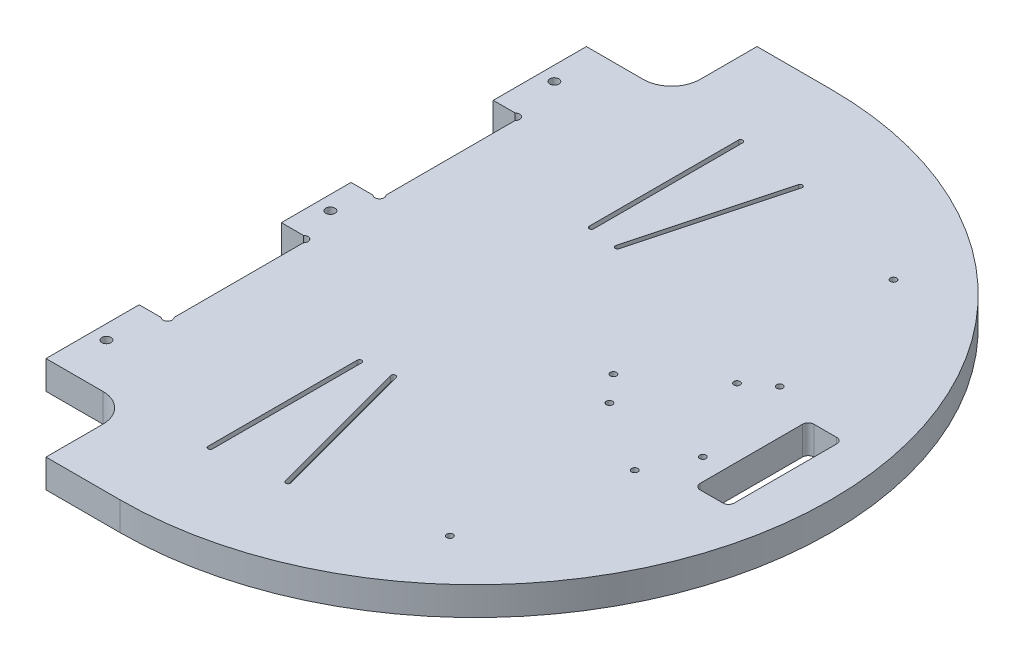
ISO-10303-21;
HEADER;
FILE_DESCRIPTION(('STEP AP214'),'2;1');
FILE_NAME('part.step','',(''),(''),'','','');
FILE_SCHEMA(('AUTOMOTIVE_DESIGN { 1 0 10303 214 1 1 1 1 }'));
ENDSEC;
DATA;
#1=APPLICATION_CONTEXT('core data for automotive mechanical design processes');
#2=APPLICATION_PROTOCOL_DEFINITION('international standard','automotive_design',2000,#1);
#3=PRODUCT_CONTEXT('',#1,'mechanical');
#4=PRODUCT('Part','Part','',(#3));
#5=PRODUCT_RELATED_PRODUCT_CATEGORY('part','',(#4));
#6=PRODUCT_DEFINITION_FORMATION('','',#4);
#7=PRODUCT_DEFINITION_CONTEXT('part definition',#1,'design');
#8=PRODUCT_DEFINITION('design','',#6,#7);
#9=PRODUCT_DEFINITION_SHAPE('','',#8);
#10=(LENGTH_UNIT() NAMED_UNIT(*) SI_UNIT(.MILLI.,.METRE.));
#11=(NAMED_UNIT(*) PLANE_ANGLE_UNIT() SI_UNIT($,.RADIAN.));
#12=(NAMED_UNIT(*) SI_UNIT($,.STERADIAN.) SOLID_ANGLE_UNIT());
#13=UNCERTAINTY_MEASURE_WITH_UNIT(LENGTH_MEASURE(1.E-05),#10,'distance_accuracy_value','');
#14=(GEOMETRIC_REPRESENTATION_CONTEXT(3) GLOBAL_UNCERTAINTY_ASSIGNED_CONTEXT((#13)) GLOBAL_UNIT_ASSIGNED_CONTEXT((#10,
#11,#12)) REPRESENTATION_CONTEXT('',''));
#15=CARTESIAN_POINT('',(0.,0.,0.));
#16=DIRECTION('',(0.,0.,1.));
#17=DIRECTION('',(1.,0.,0.));
#18=AXIS2_PLACEMENT_3D('',#15,#16,#17);
#19=CARTESIAN_POINT('',(50.,10.,0.));
#20=DIRECTION('',(0.,1.,0.));
#21=DIRECTION('',(0.,0.,1.));
#22=AXIS2_PLACEMENT_3D('',#19,#20,#21);
#23=PLANE('',#22);
#24=DIRECTION('',(5.09614442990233E-08,0.,-0.999999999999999));
#25=VECTOR('',#24,1.);
#26=CARTESIAN_POINT('',(49.1999952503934,10.,93.1999999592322));
#27=LINE('',#26,#25);
#28=CARTESIAN_POINT('',(49.1999952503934,10.,93.1999999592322));
#29=VERTEX_POINT('',#28);
#30=CARTESIAN_POINT('',(49.1999979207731,10.,40.7999999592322));
#31=VERTEX_POINT('',#30);
#32=EDGE_CURVE('E370',#29,#31,#27,.T.);
#33=ORIENTED_EDGE('',*,*,#32,.T.);
#34=CARTESIAN_POINT('',(49.9999979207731,10.,40.8000000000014));
#35=DIRECTION('',(0.,-1.,0.));
#36=DIRECTION('',(0.,0.,-1.));
#37=AXIS2_PLACEMENT_3D('',#34,#35,#36);
#38=CIRCLE('',#37,0.800000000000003);
#39=CARTESIAN_POINT('',(50.7999979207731,10.,40.8000000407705));
#40=VERTEX_POINT('',#39);
#41=EDGE_CURVE('E55',#31,#40,#38,.T.);
#42=ORIENTED_EDGE('',*,*,#41,.T.);
#43=DIRECTION('',(-5.09614445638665E-08,0.,0.999999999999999));
#44=VECTOR('',#43,1.);
#45=CARTESIAN_POINT('',(50.7999979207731,10.,40.8000000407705));
#46=LINE('',#45,#44);
#47=CARTESIAN_POINT('',(50.7999952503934,10.,93.2000000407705));
#48=VERTEX_POINT('',#47);
#49=EDGE_CURVE('E364',#40,#48,#46,.T.);
#50=ORIENTED_EDGE('',*,*,#49,.T.);
#51=CARTESIAN_POINT('',(49.9999952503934,10.,93.2000000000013));
#52=DIRECTION('',(0.,-1.,0.));
#53=DIRECTION('',(0.,0.,-1.));
#54=AXIS2_PLACEMENT_3D('',#51,#52,#53);
#55=CIRCLE('',#54,0.799999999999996);
#56=EDGE_CURVE('E367',#48,#29,#55,.T.);
#57=ORIENTED_EDGE('',*,*,#56,.T.);
#58=EDGE_LOOP('',(#33,#42,#50,#57));
#59=FACE_BOUND('',#58,.T.);
#60=CARTESIAN_POINT('',(119.,10.,-78.));
#61=DIRECTION('',(0.,-1.,0.));
#62=DIRECTION('',(0.,0.,1.));
#63=AXIS2_PLACEMENT_3D('',#60,#61,#62);
#64=CIRCLE('',#63,1.10000000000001);
#65=CARTESIAN_POINT('',(119.,10.,-76.9));
#66=VERTEX_POINT('',#65);
#67=EDGE_CURVE('E421',#66,#66,#64,.T.);
#68=ORIENTED_EDGE('',*,*,#67,.T.);
#69=EDGE_LOOP('',(#68));
#70=FACE_BOUND('',#69,.T.);
#71=CARTESIAN_POINT('',(131.5,10.,25.5));
#72=DIRECTION('',(0.,-1.,0.));
#73=DIRECTION('',(0.,0.,1.));
#74=AXIS2_PLACEMENT_3D('',#71,#72,#73);
#75=CIRCLE('',#74,1.09999999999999);
#76=CARTESIAN_POINT('',(131.5,10.,26.6));
#77=VERTEX_POINT('',#76);
#78=EDGE_CURVE('E433',#77,#77,#75,.T.);
#79=ORIENTED_EDGE('',*,*,#78,.T.);
#80=EDGE_LOOP('',(#79));
#81=FACE_BOUND('',#80,.T.);
#82=DIRECTION('',(-0.25881909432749,0.,0.965925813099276));
#83=VECTOR('',#82,1.);
#84=CARTESIAN_POINT('',(74.8946802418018,10.,-89.8172305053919));
#85=LINE('',#84,#83);
#86=CARTESIAN_POINT('',(74.8946802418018,10.,-89.8172305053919));
#87=VERTEX_POINT('',#86);
#88=CARTESIAN_POINT('',(61.3325596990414,10.,-39.2027178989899));
#89=VERTEX_POINT('',#88);
#90=EDGE_CURVE('E454',#87,#89,#85,.T.);
#91=ORIENTED_EDGE('',*,*,#90,.T.);
#92=CARTESIAN_POINT('',(60.5598190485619,10.,-39.4097731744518));
#93=DIRECTION('',(0.,-1.,0.));
#94=DIRECTION('',(0.,0.,-1.));
#95=AXIS2_PLACEMENT_3D('',#92,#93,#94);
#96=CIRCLE('',#95,0.8);
#97=CARTESIAN_POINT('',(59.7870783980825,10.,-39.6168284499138));
#98=VERTEX_POINT('',#97);
#99=EDGE_CURVE('E445',#89,#98,#96,.T.);
#100=ORIENTED_EDGE('',*,*,#99,.T.);
#101=DIRECTION('',(0.258819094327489,0.,-0.965925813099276));
#102=VECTOR('',#101,1.);
#103=CARTESIAN_POINT('',(59.7870783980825,10.,-39.6168284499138));
#104=LINE('',#103,#102);
#105=CARTESIAN_POINT('',(73.349198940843,10.,-90.2313410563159));
#106=VERTEX_POINT('',#105);
#107=EDGE_CURVE('E448',#98,#106,#104,.T.);
#108=ORIENTED_EDGE('',*,*,#107,.T.);
#109=CARTESIAN_POINT('',(74.1219395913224,10.,-90.0242857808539));
#110=DIRECTION('',(0.,-1.,0.));
#111=DIRECTION('',(0.,0.,-1.));
#112=AXIS2_PLACEMENT_3D('',#109,#110,#111);
#113=CIRCLE('',#112,0.800000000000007);
#114=EDGE_CURVE('E451',#106,#87,#113,.T.);
#115=ORIENTED_EDGE('',*,*,#114,.T.);
#116=EDGE_LOOP('',(#91,#100,#108,#115));
#117=FACE_BOUND('',#116,.T.);
#118=DIRECTION('',(0.,0.,1.));
#119=VECTOR('',#118,1.);
#120=CARTESIAN_POINT('',(147.,10.,-18.));
#121=LINE('',#120,#119);
#122=CARTESIAN_POINT('',(147.,10.,-18.));
#123=VERTEX_POINT('',#122);
#124=CARTESIAN_POINT('',(147.,10.,18.));
#125=VERTEX_POINT('',#124);
#126=EDGE_CURVE('E508',#123,#125,#121,.T.);
#127=ORIENTED_EDGE('',*,*,#126,.F.);
#128=CARTESIAN_POINT('',(149.,10.,-18.));
#129=DIRECTION('',(0.,1.,0.));
#130=DIRECTION('',(0.,0.,1.));
#131=AXIS2_PLACEMENT_3D('',#128,#129,#130);
#132=CIRCLE('',#131,2.);
#133=CARTESIAN_POINT('',(149.,10.,-20.));
#134=VERTEX_POINT('',#133);
#135=EDGE_CURVE('E506',#134,#123,#132,.T.);
#136=ORIENTED_EDGE('',*,*,#135,.F.);
#137=DIRECTION('',(-1.,0.,0.));
#138=VECTOR('',#137,1.);
#139=CARTESIAN_POINT('',(149.,10.,-20.));
#140=LINE('',#139,#138);
#141=CARTESIAN_POINT('',(157.,10.,-20.));
#142=VERTEX_POINT('',#141);
#143=EDGE_CURVE('E521',#142,#134,#140,.T.);
#144=ORIENTED_EDGE('',*,*,#143,.F.);
#145=CARTESIAN_POINT('',(157.,10.,-18.));
#146=DIRECTION('',(0.,1.,0.));
#147=DIRECTION('',(0.,0.,-1.));
#148=AXIS2_PLACEMENT_3D('',#145,#146,#147);
#149=CIRCLE('',#148,2.);
#150=CARTESIAN_POINT('',(159.,10.,-18.));
#151=VERTEX_POINT('',#150);
#152=EDGE_CURVE('E518',#151,#142,#149,.T.);
#153=ORIENTED_EDGE('',*,*,#152,.F.);
#154=DIRECTION('',(0.,0.,-1.));
#155=VECTOR('',#154,1.);
#156=CARTESIAN_POINT('',(159.,10.,-18.));
#157=LINE('',#156,#155);
#158=CARTESIAN_POINT('',(159.,10.,18.));
#159=VERTEX_POINT('',#158);
#160=EDGE_CURVE('E516',#159,#151,#157,.T.);
#161=ORIENTED_EDGE('',*,*,#160,.F.);
#162=CARTESIAN_POINT('',(157.,10.,18.));
#163=DIRECTION('',(0.,1.,0.));
#164=DIRECTION('',(0.,0.,1.));
#165=AXIS2_PLACEMENT_3D('',#162,#163,#164);
#166=CIRCLE('',#165,2.);
#167=CARTESIAN_POINT('',(157.,10.,20.));
#168=VERTEX_POINT('',#167);
#169=EDGE_CURVE('E514',#168,#159,#166,.T.);
#170=ORIENTED_EDGE('',*,*,#169,.F.);
#171=DIRECTION('',(1.,0.,0.));
#172=VECTOR('',#171,1.);
#173=CARTESIAN_POINT('',(149.,10.,20.));
#174=LINE('',#173,#172);
#175=CARTESIAN_POINT('',(149.,10.,20.));
#176=VERTEX_POINT('',#175);
#177=EDGE_CURVE('E512',#176,#168,#174,.T.);
#178=ORIENTED_EDGE('',*,*,#177,.F.);
#179=CARTESIAN_POINT('',(149.,10.,18.));
#180=DIRECTION('',(0.,1.,0.));
#181=DIRECTION('',(0.,0.,1.));
#182=AXIS2_PLACEMENT_3D('',#179,#180,#181);
#183=CIRCLE('',#182,2.);
#184=EDGE_CURVE('E510',#125,#176,#183,.T.);
#185=ORIENTED_EDGE('',*,*,#184,.F.);
#186=EDGE_LOOP('',(#127,#136,#144,#153,#161,#170,#178,#185));
#187=FACE_BOUND('',#186,.T.);
#188=CARTESIAN_POINT('',(-1.00000000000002,10.,78.75));
#189=DIRECTION('',(0.,1.,0.));
#190=DIRECTION('',(0.,0.,-1.));
#191=AXIS2_PLACEMENT_3D('',#188,#189,#190);
#192=CIRCLE('',#191,1.6);
#193=CARTESIAN_POINT('',(-1.00000000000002,10.,77.15));
#194=VERTEX_POINT('',#193);
#195=EDGE_CURVE('E550',#194,#194,#192,.T.);
#196=ORIENTED_EDGE('',*,*,#195,.F.);
#197=EDGE_LOOP('',(#196));
#198=FACE_BOUND('',#197,.T.);
#199=CARTESIAN_POINT('',(106.589005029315,10.,9.47489236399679));
#200=DIRECTION('',(0.,1.,0.));
#201=DIRECTION('',(0.,0.,1.));
#202=AXIS2_PLACEMENT_3D('',#199,#200,#201);
#203=CIRCLE('',#202,1.1);
#204=CARTESIAN_POINT('',(106.589005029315,10.,10.5748923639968));
#205=VERTEX_POINT('',#204);
#206=EDGE_CURVE('E562',#205,#205,#203,.T.);
#207=ORIENTED_EDGE('',*,*,#206,.F.);
#208=EDGE_LOOP('',(#207));
#209=FACE_BOUND('',#208,.T.);
#210=CARTESIAN_POINT('',(123.,10.,-18.9497847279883));
#211=DIRECTION('',(0.,1.,0.));
#212=DIRECTION('',(0.,0.,1.));
#213=AXIS2_PLACEMENT_3D('',#210,#211,#212);
#214=CIRCLE('',#213,1.10000000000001);
#215=CARTESIAN_POINT('',(123.,10.,-17.8497847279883));
#216=VERTEX_POINT('',#215);
#217=EDGE_CURVE('E574',#216,#216,#214,.T.);
#218=ORIENTED_EDGE('',*,*,#217,.F.);
#219=EDGE_LOOP('',(#218));
#220=FACE_BOUND('',#219,.T.);
#221=CARTESIAN_POINT('',(50.,10.,0.));
#222=DIRECTION('',(0.,1.,0.));
#223=DIRECTION('',(0.,0.,1.));
#224=AXIS2_PLACEMENT_3D('',#221,#222,#223);
#225=CIRCLE('',#224,125.);
#226=CARTESIAN_POINT('',(50.,10.,125.));
#227=VERTEX_POINT('',#226);
#228=CARTESIAN_POINT('',(50.,10.,-125.));
#229=VERTEX_POINT('',#228);
#230=EDGE_CURVE('E622',#227,#229,#225,.T.);
#231=ORIENTED_EDGE('',*,*,#230,.T.);
#232=DIRECTION('',(-1.,0.,0.));
#233=VECTOR('',#232,1.);
#234=CARTESIAN_POINT('',(50.,10.,-125.));
#235=LINE('',#234,#233);
#236=CARTESIAN_POINT('',(24.,10.,-125.));
#237=VERTEX_POINT('',#236);
#238=EDGE_CURVE('E625',#229,#237,#235,.T.);
#239=ORIENTED_EDGE('',*,*,#238,.T.);
#240=DIRECTION('',(0.,0.,1.));
#241=VECTOR('',#240,1.);
#242=CARTESIAN_POINT('',(24.,10.,-125.));
#243=LINE('',#242,#241);
#244=CARTESIAN_POINT('',(24.,10.,-105.));
#245=VERTEX_POINT('',#244);
#246=EDGE_CURVE('E627',#237,#245,#243,.T.);
#247=ORIENTED_EDGE('',*,*,#246,.T.);
#248=CARTESIAN_POINT('',(14.,10.,-105.));
#249=DIRECTION('',(0.,-1.,0.));
#250=DIRECTION('',(0.,0.,-1.));
#251=AXIS2_PLACEMENT_3D('',#248,#249,#250);
#252=CIRCLE('',#251,10.);
#253=CARTESIAN_POINT('',(13.9999999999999,10.,-95.));
#254=VERTEX_POINT('',#253);
#255=EDGE_CURVE('E629',#245,#254,#252,.T.);
#256=ORIENTED_EDGE('',*,*,#255,.T.);
#257=DIRECTION('',(-1.,0.,0.));
#258=VECTOR('',#257,1.);
#259=CARTESIAN_POINT('',(-6.00000000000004,10.,-95.));
#260=LINE('',#259,#258);
#261=CARTESIAN_POINT('',(-6.00000000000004,10.,-95.));
#262=VERTEX_POINT('',#261);
#263=EDGE_CURVE('E631',#254,#262,#260,.T.);
#264=ORIENTED_EDGE('',*,*,#263,.T.);
#265=DIRECTION('',(0.,0.,1.));
#266=VECTOR('',#265,1.);
#267=CARTESIAN_POINT('',(-6.00000000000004,10.,-95.));
#268=LINE('',#267,#266);
#269=CARTESIAN_POINT('',(-6.00000000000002,10.,-62.25));
#270=VERTEX_POINT('',#269);
#271=EDGE_CURVE('E633',#262,#270,#268,.T.);
#272=ORIENTED_EDGE('',*,*,#271,.T.);
#273=DIRECTION('',(1.,0.,0.));
#274=VECTOR('',#273,1.);
#275=CARTESIAN_POINT('',(1.73725830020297,10.,-62.25));
#276=LINE('',#275,#274);
#277=CARTESIAN_POINT('',(1.73725830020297,10.,-62.25));
#278=VERTEX_POINT('',#277);
#279=EDGE_CURVE('E635',#270,#278,#276,.T.);
#280=ORIENTED_EDGE('',*,*,#279,.T.);
#281=CARTESIAN_POINT('',(2.86862915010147,10.,-61.1186291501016));
#282=DIRECTION('',(0.,-1.,0.));
#283=DIRECTION('',(0.,0.,1.));
#284=AXIS2_PLACEMENT_3D('',#281,#282,#283);
#285=CIRCLE('',#284,1.6);
#286=CARTESIAN_POINT('',(3.99999999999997,10.,-59.9872583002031));
#287=VERTEX_POINT('',#286);
#288=EDGE_CURVE('E637',#278,#287,#285,.T.);
#289=ORIENTED_EDGE('',*,*,#288,.T.);
#290=DIRECTION('',(0.,0.,1.));
#291=VECTOR('',#290,1.);
#292=CARTESIAN_POINT('',(3.99999999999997,10.,-59.9872583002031));
#293=LINE('',#292,#291);
#294=CARTESIAN_POINT('',(3.99999999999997,10.,-14.5127416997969));
#295=VERTEX_POINT('',#294);
#296=EDGE_CURVE('E639',#287,#295,#293,.T.);
#297=ORIENTED_EDGE('',*,*,#296,.T.);
#298=CARTESIAN_POINT('',(2.86862915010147,10.,-13.3813708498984));
#299=DIRECTION('',(0.,-1.,0.));
#300=DIRECTION('',(0.,0.,-1.));
#301=AXIS2_PLACEMENT_3D('',#298,#299,#300);
#302=CIRCLE('',#301,1.6);
#303=CARTESIAN_POINT('',(1.73725830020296,10.,-12.25));
#304=VERTEX_POINT('',#303);
#305=EDGE_CURVE('E641',#295,#304,#302,.T.);
#306=ORIENTED_EDGE('',*,*,#305,.T.);
#307=DIRECTION('',(-1.,0.,0.));
#308=VECTOR('',#307,1.);
#309=CARTESIAN_POINT('',(1.73725830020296,10.,-12.25));
#310=LINE('',#309,#308);
#311=CARTESIAN_POINT('',(-6.00000000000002,10.,-12.25));
#312=VERTEX_POINT('',#311);
#313=EDGE_CURVE('E643',#304,#312,#310,.T.);
#314=ORIENTED_EDGE('',*,*,#313,.T.);
#315=DIRECTION('',(0.,0.,1.));
#316=VECTOR('',#315,1.);
#317=CARTESIAN_POINT('',(-6.00000000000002,10.,-12.25));
#318=LINE('',#317,#316);
#319=CARTESIAN_POINT('',(-6.00000000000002,10.,12.25));
#320=VERTEX_POINT('',#319);
#321=EDGE_CURVE('E645',#312,#320,#318,.T.);
#322=ORIENTED_EDGE('',*,*,#321,.T.);
#323=DIRECTION('',(1.,0.,0.));
#324=VECTOR('',#323,1.);
#325=CARTESIAN_POINT('',(1.73725830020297,10.,12.25));
#326=LINE('',#325,#324);
#327=CARTESIAN_POINT('',(1.73725830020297,10.,12.25));
#328=VERTEX_POINT('',#327);
#329=EDGE_CURVE('E647',#320,#328,#326,.T.);
#330=ORIENTED_EDGE('',*,*,#329,.T.);
#331=CARTESIAN_POINT('',(2.86862915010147,10.,13.3813708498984));
#332=DIRECTION('',(0.,-1.,0.));
#333=DIRECTION('',(0.,0.,1.));
#334=AXIS2_PLACEMENT_3D('',#331,#332,#333);
#335=CIRCLE('',#334,1.6);
#336=CARTESIAN_POINT('',(3.99999999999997,10.,14.5127416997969));
#337=VERTEX_POINT('',#336);
#338=EDGE_CURVE('E649',#328,#337,#335,.T.);
#339=ORIENTED_EDGE('',*,*,#338,.T.);
#340=DIRECTION('',(0.,0.,1.));
#341=VECTOR('',#340,1.);
#342=CARTESIAN_POINT('',(3.99999999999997,10.,14.5127416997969));
#343=LINE('',#342,#341);
#344=CARTESIAN_POINT('',(4.00000000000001,10.,59.9872583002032));
#345=VERTEX_POINT('',#344);
#346=EDGE_CURVE('E651',#337,#345,#343,.T.);
#347=ORIENTED_EDGE('',*,*,#346,.T.);
#348=CARTESIAN_POINT('',(2.86862915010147,10.,61.1186291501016));
#349=DIRECTION('',(0.,-1.,0.));
#350=DIRECTION('',(0.,0.,-1.));
#351=AXIS2_PLACEMENT_3D('',#348,#349,#350);
#352=CIRCLE('',#351,1.6);
#353=CARTESIAN_POINT('',(1.73725830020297,10.,62.25));
#354=VERTEX_POINT('',#353);
#355=EDGE_CURVE('E653',#345,#354,#352,.T.);
#356=ORIENTED_EDGE('',*,*,#355,.T.);
#357=DIRECTION('',(-1.,0.,0.));
#358=VECTOR('',#357,1.);
#359=CARTESIAN_POINT('',(1.73725830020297,10.,62.25));
#360=LINE('',#359,#358);
#361=CARTESIAN_POINT('',(-6.00000000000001,10.,62.25));
#362=VERTEX_POINT('',#361);
#363=EDGE_CURVE('E655',#354,#362,#360,.T.);
#364=ORIENTED_EDGE('',*,*,#363,.T.);
#365=DIRECTION('',(0.,0.,1.));
#366=VECTOR('',#365,1.);
#367=CARTESIAN_POINT('',(-6.00000000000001,10.,62.25));
#368=LINE('',#367,#366);
#369=CARTESIAN_POINT('',(-6.,10.,95.));
#370=VERTEX_POINT('',#369);
#371=EDGE_CURVE('E657',#362,#370,#368,.T.);
#372=ORIENTED_EDGE('',*,*,#371,.T.);
#373=DIRECTION('',(1.,0.,0.));
#374=VECTOR('',#373,1.);
#375=CARTESIAN_POINT('',(-6.,10.,95.));
#376=LINE('',#375,#374);
#377=CARTESIAN_POINT('',(13.9999999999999,10.,95.));
#378=VERTEX_POINT('',#377);
#379=EDGE_CURVE('E659',#370,#378,#376,.T.);
#380=ORIENTED_EDGE('',*,*,#379,.T.);
#381=CARTESIAN_POINT('',(14.,10.,105.));
#382=DIRECTION('',(0.,-1.,0.));
#383=DIRECTION('',(0.,0.,1.));
#384=AXIS2_PLACEMENT_3D('',#381,#382,#383);
#385=CIRCLE('',#384,10.);
#386=CARTESIAN_POINT('',(24.,10.,105.));
#387=VERTEX_POINT('',#386);
#388=EDGE_CURVE('E661',#378,#387,#385,.T.);
#389=ORIENTED_EDGE('',*,*,#388,.T.);
#390=DIRECTION('',(0.,0.,1.));
#391=VECTOR('',#390,1.);
#392=CARTESIAN_POINT('',(24.,10.,125.));
#393=LINE('',#392,#391);
#394=CARTESIAN_POINT('',(24.,10.,125.));
#395=VERTEX_POINT('',#394);
#396=EDGE_CURVE('E663',#387,#395,#393,.T.);
#397=ORIENTED_EDGE('',*,*,#396,.T.);
#398=DIRECTION('',(1.,0.,0.));
#399=VECTOR('',#398,1.);
#400=CARTESIAN_POINT('',(50.,10.,125.));
#401=LINE('',#400,#399);
#402=EDGE_CURVE('E665',#395,#227,#401,.T.);
#403=ORIENTED_EDGE('',*,*,#402,.T.);
#404=EDGE_LOOP('',(#231,#239,#247,#256,#264,#272,#280,#289,#297,#306,#314,#322,#330,#339,#347,
#356,#364,#372,#380,#389,#397,#403));
#405=FACE_BOUND('',#404,.T.);
#406=CARTESIAN_POINT('',(139.410994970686,10.,9.47489236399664));
#407=DIRECTION('',(0.,1.,0.));
#408=DIRECTION('',(0.,0.,1.));
#409=AXIS2_PLACEMENT_3D('',#406,#407,#408);
#410=CIRCLE('',#409,1.1);
#411=CARTESIAN_POINT('',(139.410994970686,10.,10.5748923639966));
#412=VERTEX_POINT('',#411);
#413=EDGE_CURVE('E568',#412,#412,#410,.T.);
#414=ORIENTED_EDGE('',*,*,#413,.F.);
#415=EDGE_LOOP('',(#414));
#416=FACE_BOUND('',#415,.T.);
#417=CARTESIAN_POINT('',(-1.00000000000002,10.,-78.75));
#418=DIRECTION('',(0.,1.,0.));
#419=DIRECTION('',(0.,0.,1.));
#420=AXIS2_PLACEMENT_3D('',#417,#418,#419);
#421=CIRCLE('',#420,1.6);
#422=CARTESIAN_POINT('',(-1.00000000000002,10.,-77.15));
#423=VERTEX_POINT('',#422);
#424=EDGE_CURVE('E556',#423,#423,#421,.T.);
#425=ORIENTED_EDGE('',*,*,#424,.F.);
#426=EDGE_LOOP('',(#425));
#427=FACE_BOUND('',#426,.T.);
#428=CARTESIAN_POINT('',(-1.00000000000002,10.,0.));
#429=DIRECTION('',(0.,1.,0.));
#430=DIRECTION('',(0.,0.,1.));
#431=AXIS2_PLACEMENT_3D('',#428,#429,#430);
#432=CIRCLE('',#431,1.6);
#433=CARTESIAN_POINT('',(-1.00000000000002,10.,1.6));
#434=VERTEX_POINT('',#433);
#435=EDGE_CURVE('E544',#434,#434,#432,.T.);
#436=ORIENTED_EDGE('',*,*,#435,.F.);
#437=EDGE_LOOP('',(#436));
#438=FACE_BOUND('',#437,.T.);
#439=CARTESIAN_POINT('',(98.5,10.,0.));
#440=DIRECTION('',(0.,-1.,0.));
#441=DIRECTION('',(0.,0.,-1.));
#442=AXIS2_PLACEMENT_3D('',#439,#440,#441);
#443=CIRCLE('',#442,1.09999999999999);
#444=CARTESIAN_POINT('',(98.5,10.,-1.09999999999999));
#445=VERTEX_POINT('',#444);
#446=EDGE_CURVE('E476',#445,#445,#443,.T.);
#447=ORIENTED_EDGE('',*,*,#446,.T.);
#448=EDGE_LOOP('',(#447));
#449=FACE_BOUND('',#448,.T.);
#450=CARTESIAN_POINT('',(131.5,10.,-25.5));
#451=DIRECTION('',(0.,-1.,0.));
#452=DIRECTION('',(0.,0.,-1.));
#453=AXIS2_PLACEMENT_3D('',#450,#451,#452);
#454=CIRCLE('',#453,1.09999999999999);
#455=CARTESIAN_POINT('',(131.5,10.,-26.6));
#456=VERTEX_POINT('',#455);
#457=EDGE_CURVE('E439',#456,#456,#454,.T.);
#458=ORIENTED_EDGE('',*,*,#457,.T.);
#459=EDGE_LOOP('',(#458));
#460=FACE_BOUND('',#459,.T.);
#461=CARTESIAN_POINT('',(119.,10.,78.));
#462=DIRECTION('',(0.,-1.,0.));
#463=DIRECTION('',(0.,0.,-1.));
#464=AXIS2_PLACEMENT_3D('',#461,#462,#463);
#465=CIRCLE('',#464,1.10000000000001);
#466=CARTESIAN_POINT('',(119.,10.,76.9));
#467=VERTEX_POINT('',#466);
#468=EDGE_CURVE('E427',#467,#467,#465,.T.);
#469=ORIENTED_EDGE('',*,*,#468,.T.);
#470=EDGE_LOOP('',(#469));
#471=FACE_BOUND('',#470,.T.);
#472=DIRECTION('',(-0.258818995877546,0.,-0.965925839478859));
#473=VECTOR('',#472,1.);
#474=CARTESIAN_POINT('',(73.3491897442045,10.,90.2313434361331));
#475=LINE('',#474,#473);
#476=CARTESIAN_POINT('',(73.3491897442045,10.,90.2313434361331));
#477=VERTEX_POINT('',#476);
#478=CARTESIAN_POINT('',(59.7870743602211,10.,39.6168294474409));
#479=VERTEX_POINT('',#478);
#480=EDGE_CURVE('E399',#477,#479,#475,.T.);
#481=ORIENTED_EDGE('',*,*,#480,.T.);
#482=CARTESIAN_POINT('',(60.5598150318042,10.,39.4097742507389));
#483=DIRECTION('',(0.,-1.,0.));
#484=DIRECTION('',(0.,0.,-1.));
#485=AXIS2_PLACEMENT_3D('',#482,#483,#484);
#486=CIRCLE('',#485,0.800000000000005);
#487=CARTESIAN_POINT('',(61.3325557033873,10.,39.2027190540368));
#488=VERTEX_POINT('',#487);
#489=EDGE_CURVE('E390',#479,#488,#486,.T.);
#490=ORIENTED_EDGE('',*,*,#489,.T.);
#491=DIRECTION('',(0.258818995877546,0.,0.965925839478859));
#492=VECTOR('',#491,1.);
#493=CARTESIAN_POINT('',(61.3325557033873,10.,39.2027190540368));
#494=LINE('',#493,#492);
#495=CARTESIAN_POINT('',(74.8946710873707,10.,89.8172330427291));
#496=VERTEX_POINT('',#495);
#497=EDGE_CURVE('E393',#488,#496,#494,.T.);
#498=ORIENTED_EDGE('',*,*,#497,.T.);
#499=CARTESIAN_POINT('',(74.1219304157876,10.,90.0242882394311));
#500=DIRECTION('',(0.,-1.,0.));
#501=DIRECTION('',(0.,0.,-1.));
#502=AXIS2_PLACEMENT_3D('',#499,#500,#501);
#503=CIRCLE('',#502,0.799999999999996);
#504=EDGE_CURVE('E396',#496,#477,#503,.T.);
#505=ORIENTED_EDGE('',*,*,#504,.T.);
#506=EDGE_LOOP('',(#481,#490,#498,#505));
#507=FACE_BOUND('',#506,.T.);
#508=DIRECTION('',(-5.09614372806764E-08,0.,0.999999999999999));
#509=VECTOR('',#508,1.);
#510=CARTESIAN_POINT('',(50.800004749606,10.,-93.1999999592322));
#511=LINE('',#510,#509);
#512=CARTESIAN_POINT('',(50.800004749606,10.,-93.1999999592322));
#513=VERTEX_POINT('',#512);
#514=CARTESIAN_POINT('',(50.8000020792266,10.,-40.7999999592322));
#515=VERTEX_POINT('',#514);
#516=EDGE_CURVE('E346',#513,#515,#511,.T.);
#517=ORIENTED_EDGE('',*,*,#516,.T.);
#518=CARTESIAN_POINT('',(50.0000020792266,10.,-40.8000000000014));
#519=DIRECTION('',(0.,-1.,0.));
#520=DIRECTION('',(0.,0.,-1.));
#521=AXIS2_PLACEMENT_3D('',#518,#519,#520);
#522=CIRCLE('',#521,0.800000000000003);
#523=CARTESIAN_POINT('',(49.2000020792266,10.,-40.8000000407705));
#524=VERTEX_POINT('',#523);
#525=EDGE_CURVE('E47',#515,#524,#522,.T.);
#526=ORIENTED_EDGE('',*,*,#525,.T.);
#527=DIRECTION('',(5.09614375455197E-08,0.,-0.999999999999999));
#528=VECTOR('',#527,1.);
#529=CARTESIAN_POINT('',(49.2000020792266,10.,-40.8000000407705));
#530=LINE('',#529,#528);
#531=CARTESIAN_POINT('',(49.200004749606,10.,-93.2000000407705));
#532=VERTEX_POINT('',#531);
#533=EDGE_CURVE('E329',#524,#532,#530,.T.);
#534=ORIENTED_EDGE('',*,*,#533,.T.);
#535=CARTESIAN_POINT('',(50.000004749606,10.,-93.2000000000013));
#536=DIRECTION('',(0.,-1.,0.));
#537=DIRECTION('',(0.,0.,-1.));
#538=AXIS2_PLACEMENT_3D('',#535,#536,#537);
#539=CIRCLE('',#538,0.799999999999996);
#540=EDGE_CURVE('E337',#532,#513,#539,.T.);
#541=ORIENTED_EDGE('',*,*,#540,.T.);
#542=EDGE_LOOP('',(#517,#526,#534,#541));
#543=FACE_BOUND('',#542,.T.);
#544=ADVANCED_FACE('F32',(#59,#70,#81,#117,#187,#198,#209,#220,#405,#416,#427,#438,#449,#460,
#471,#507,#543),#23,.T.);
#545=CARTESIAN_POINT('',(50.,0.,0.));
#546=DIRECTION('',(0.,1.,0.));
#547=DIRECTION('',(0.,0.,1.));
#548=AXIS2_PLACEMENT_3D('',#545,#546,#547);
#549=PLANE('',#548);
#550=CARTESIAN_POINT('',(-1.00000000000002,0.,0.));
#551=DIRECTION('',(0.,1.,0.));
#552=DIRECTION('',(0.,0.,1.));
#553=AXIS2_PLACEMENT_3D('',#550,#551,#552);
#554=CIRCLE('',#553,1.6);
#555=CARTESIAN_POINT('',(-1.00000000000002,0.,1.6));
#556=VERTEX_POINT('',#555);
#557=EDGE_CURVE('E541',#556,#556,#554,.T.);
#558=ORIENTED_EDGE('',*,*,#557,.T.);
#559=EDGE_LOOP('',(#558));
#560=FACE_BOUND('',#559,.T.);
#561=CARTESIAN_POINT('',(-1.00000000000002,0.,-78.75));
#562=DIRECTION('',(0.,1.,0.));
#563=DIRECTION('',(0.,0.,1.));
#564=AXIS2_PLACEMENT_3D('',#561,#562,#563);
#565=CIRCLE('',#564,1.6);
#566=CARTESIAN_POINT('',(-1.00000000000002,0.,-77.15));
#567=VERTEX_POINT('',#566);
#568=EDGE_CURVE('E553',#567,#567,#565,.T.);
#569=ORIENTED_EDGE('',*,*,#568,.T.);
#570=EDGE_LOOP('',(#569));
#571=FACE_BOUND('',#570,.T.);
#572=CARTESIAN_POINT('',(139.410994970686,0.,9.47489236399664));
#573=DIRECTION('',(0.,1.,0.));
#574=DIRECTION('',(0.,0.,1.));
#575=AXIS2_PLACEMENT_3D('',#572,#573,#574);
#576=CIRCLE('',#575,1.1);
#577=CARTESIAN_POINT('',(139.410994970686,0.,10.5748923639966));
#578=VERTEX_POINT('',#577);
#579=EDGE_CURVE('E565',#578,#578,#576,.T.);
#580=ORIENTED_EDGE('',*,*,#579,.T.);
#581=EDGE_LOOP('',(#580));
#582=FACE_BOUND('',#581,.T.);
#583=CARTESIAN_POINT('',(50.,0.,0.));
#584=DIRECTION('',(0.,1.,0.));
#585=DIRECTION('',(0.,0.,1.));
#586=AXIS2_PLACEMENT_3D('',#583,#584,#585);
#587=CIRCLE('',#586,125.);
#588=CARTESIAN_POINT('',(50.,0.,125.));
#589=VERTEX_POINT('',#588);
#590=CARTESIAN_POINT('',(50.,0.,-125.));
#591=VERTEX_POINT('',#590);
#592=EDGE_CURVE('E577',#589,#591,#587,.T.);
#593=ORIENTED_EDGE('',*,*,#592,.F.);
#594=DIRECTION('',(1.,0.,0.));
#595=VECTOR('',#594,1.);
#596=CARTESIAN_POINT('',(50.,0.,125.));
#597=LINE('',#596,#595);
#598=CARTESIAN_POINT('',(24.,0.,125.));
#599=VERTEX_POINT('',#598);
#600=EDGE_CURVE('E620',#599,#589,#597,.T.);
#601=ORIENTED_EDGE('',*,*,#600,.F.);
#602=DIRECTION('',(0.,0.,1.));
#603=VECTOR('',#602,1.);
#604=CARTESIAN_POINT('',(24.,0.,125.));
#605=LINE('',#604,#603);
#606=CARTESIAN_POINT('',(24.,0.,105.));
#607=VERTEX_POINT('',#606);
#608=EDGE_CURVE('E618',#607,#599,#605,.T.);
#609=ORIENTED_EDGE('',*,*,#608,.F.);
#610=CARTESIAN_POINT('',(14.,0.,105.));
#611=DIRECTION('',(0.,-1.,0.));
#612=DIRECTION('',(0.,0.,1.));
#613=AXIS2_PLACEMENT_3D('',#610,#611,#612);
#614=CIRCLE('',#613,10.);
#615=CARTESIAN_POINT('',(13.9999999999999,0.,95.));
#616=VERTEX_POINT('',#615);
#617=EDGE_CURVE('E616',#616,#607,#614,.T.);
#618=ORIENTED_EDGE('',*,*,#617,.F.);
#619=DIRECTION('',(1.,0.,0.));
#620=VECTOR('',#619,1.);
#621=CARTESIAN_POINT('',(-6.,0.,95.));
#622=LINE('',#621,#620);
#623=CARTESIAN_POINT('',(-6.,0.,95.));
#624=VERTEX_POINT('',#623);
#625=EDGE_CURVE('E614',#624,#616,#622,.T.);
#626=ORIENTED_EDGE('',*,*,#625,.F.);
#627=DIRECTION('',(0.,0.,1.));
#628=VECTOR('',#627,1.);
#629=CARTESIAN_POINT('',(-6.00000000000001,0.,62.25));
#630=LINE('',#629,#628);
#631=CARTESIAN_POINT('',(-6.00000000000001,0.,62.25));
#632=VERTEX_POINT('',#631);
#633=EDGE_CURVE('E612',#632,#624,#630,.T.);
#634=ORIENTED_EDGE('',*,*,#633,.F.);
#635=DIRECTION('',(-1.,0.,0.));
#636=VECTOR('',#635,1.);
#637=CARTESIAN_POINT('',(1.73725830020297,0.,62.25));
#638=LINE('',#637,#636);
#639=CARTESIAN_POINT('',(1.73725830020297,0.,62.25));
#640=VERTEX_POINT('',#639);
#641=EDGE_CURVE('E610',#640,#632,#638,.T.);
#642=ORIENTED_EDGE('',*,*,#641,.F.);
#643=CARTESIAN_POINT('',(2.86862915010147,0.,61.1186291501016));
#644=DIRECTION('',(0.,-1.,0.));
#645=DIRECTION('',(0.,0.,-1.));
#646=AXIS2_PLACEMENT_3D('',#643,#644,#645);
#647=CIRCLE('',#646,1.6);
#648=CARTESIAN_POINT('',(4.00000000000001,0.,59.9872583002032));
#649=VERTEX_POINT('',#648);
#650=EDGE_CURVE('E608',#649,#640,#647,.T.);
#651=ORIENTED_EDGE('',*,*,#650,.F.);
#652=DIRECTION('',(0.,0.,1.));
#653=VECTOR('',#652,1.);
#654=CARTESIAN_POINT('',(3.99999999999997,0.,14.5127416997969));
#655=LINE('',#654,#653);
#656=CARTESIAN_POINT('',(3.99999999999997,0.,14.5127416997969));
#657=VERTEX_POINT('',#656);
#658=EDGE_CURVE('E606',#657,#649,#655,.T.);
#659=ORIENTED_EDGE('',*,*,#658,.F.);
#660=CARTESIAN_POINT('',(2.86862915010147,0.,13.3813708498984));
#661=DIRECTION('',(0.,-1.,0.));
#662=DIRECTION('',(0.,0.,1.));
#663=AXIS2_PLACEMENT_3D('',#660,#661,#662);
#664=CIRCLE('',#663,1.6);
#665=CARTESIAN_POINT('',(1.73725830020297,0.,12.25));
#666=VERTEX_POINT('',#665);
#667=EDGE_CURVE('E604',#666,#657,#664,.T.);
#668=ORIENTED_EDGE('',*,*,#667,.F.);
#669=DIRECTION('',(1.,0.,0.));
#670=VECTOR('',#669,1.);
#671=CARTESIAN_POINT('',(1.73725830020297,0.,12.25));
#672=LINE('',#671,#670);
#673=CARTESIAN_POINT('',(-6.00000000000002,0.,12.25));
#674=VERTEX_POINT('',#673);
#675=EDGE_CURVE('E602',#674,#666,#672,.T.);
#676=ORIENTED_EDGE('',*,*,#675,.F.);
#677=DIRECTION('',(0.,0.,1.));
#678=VECTOR('',#677,1.);
#679=CARTESIAN_POINT('',(-6.00000000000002,0.,-12.25));
#680=LINE('',#679,#678);
#681=CARTESIAN_POINT('',(-6.00000000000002,0.,-12.25));
#682=VERTEX_POINT('',#681);
#683=EDGE_CURVE('E600',#682,#674,#680,.T.);
#684=ORIENTED_EDGE('',*,*,#683,.F.);
#685=DIRECTION('',(-1.,0.,0.));
#686=VECTOR('',#685,1.);
#687=CARTESIAN_POINT('',(1.73725830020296,0.,-12.25));
#688=LINE('',#687,#686);
#689=CARTESIAN_POINT('',(1.73725830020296,0.,-12.25));
#690=VERTEX_POINT('',#689);
#691=EDGE_CURVE('E598',#690,#682,#688,.T.);
#692=ORIENTED_EDGE('',*,*,#691,.F.);
#693=CARTESIAN_POINT('',(2.86862915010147,0.,-13.3813708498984));
#694=DIRECTION('',(0.,-1.,0.));
#695=DIRECTION('',(0.,0.,-1.));
#696=AXIS2_PLACEMENT_3D('',#693,#694,#695);
#697=CIRCLE('',#696,1.6);
#698=CARTESIAN_POINT('',(3.99999999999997,0.,-14.5127416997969));
#699=VERTEX_POINT('',#698);
#700=EDGE_CURVE('E596',#699,#690,#697,.T.);
#701=ORIENTED_EDGE('',*,*,#700,.F.);
#702=DIRECTION('',(0.,0.,1.));
#703=VECTOR('',#702,1.);
#704=CARTESIAN_POINT('',(3.99999999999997,0.,-59.9872583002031));
#705=LINE('',#704,#703);
#706=CARTESIAN_POINT('',(3.99999999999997,0.,-59.9872583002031));
#707=VERTEX_POINT('',#706);
#708=EDGE_CURVE('E594',#707,#699,#705,.T.);
#709=ORIENTED_EDGE('',*,*,#708,.F.);
#710=CARTESIAN_POINT('',(2.86862915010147,0.,-61.1186291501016));
#711=DIRECTION('',(0.,-1.,0.));
#712=DIRECTION('',(0.,0.,1.));
#713=AXIS2_PLACEMENT_3D('',#710,#711,#712);
#714=CIRCLE('',#713,1.6);
#715=CARTESIAN_POINT('',(1.73725830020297,0.,-62.25));
#716=VERTEX_POINT('',#715);
#717=EDGE_CURVE('E592',#716,#707,#714,.T.);
#718=ORIENTED_EDGE('',*,*,#717,.F.);
#719=DIRECTION('',(1.,0.,0.));
#720=VECTOR('',#719,1.);
#721=CARTESIAN_POINT('',(1.73725830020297,0.,-62.25));
#722=LINE('',#721,#720);
#723=CARTESIAN_POINT('',(-6.00000000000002,0.,-62.25));
#724=VERTEX_POINT('',#723);
#725=EDGE_CURVE('E590',#724,#716,#722,.T.);
#726=ORIENTED_EDGE('',*,*,#725,.F.);
#727=DIRECTION('',(0.,0.,1.));
#728=VECTOR('',#727,1.);
#729=CARTESIAN_POINT('',(-6.00000000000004,0.,-95.));
#730=LINE('',#729,#728);
#731=CARTESIAN_POINT('',(-6.00000000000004,0.,-95.));
#732=VERTEX_POINT('',#731);
#733=EDGE_CURVE('E588',#732,#724,#730,.T.);
#734=ORIENTED_EDGE('',*,*,#733,.F.);
#735=DIRECTION('',(-1.,0.,0.));
#736=VECTOR('',#735,1.);
#737=CARTESIAN_POINT('',(-6.00000000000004,0.,-95.));
#738=LINE('',#737,#736);
#739=CARTESIAN_POINT('',(13.9999999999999,0.,-95.));
#740=VERTEX_POINT('',#739);
#741=EDGE_CURVE('E586',#740,#732,#738,.T.);
#742=ORIENTED_EDGE('',*,*,#741,.F.);
#743=CARTESIAN_POINT('',(14.,0.,-105.));
#744=DIRECTION('',(0.,-1.,0.));
#745=DIRECTION('',(0.,0.,-1.));
#746=AXIS2_PLACEMENT_3D('',#743,#744,#745);
#747=CIRCLE('',#746,10.);
#748=CARTESIAN_POINT('',(24.,0.,-105.));
#749=VERTEX_POINT('',#748);
#750=EDGE_CURVE('E584',#749,#740,#747,.T.);
#751=ORIENTED_EDGE('',*,*,#750,.F.);
#752=DIRECTION('',(0.,0.,1.));
#753=VECTOR('',#752,1.);
#754=CARTESIAN_POINT('',(24.,0.,-125.));
#755=LINE('',#754,#753);
#756=CARTESIAN_POINT('',(24.,0.,-125.));
#757=VERTEX_POINT('',#756);
#758=EDGE_CURVE('E582',#757,#749,#755,.T.);
#759=ORIENTED_EDGE('',*,*,#758,.F.);
#760=DIRECTION('',(-1.,0.,0.));
#761=VECTOR('',#760,1.);
#762=CARTESIAN_POINT('',(50.,0.,-125.));
#763=LINE('',#762,#761);
#764=EDGE_CURVE('E580',#591,#757,#763,.T.);
#765=ORIENTED_EDGE('',*,*,#764,.F.);
#766=EDGE_LOOP('',(#593,#601,#609,#618,#626,#634,#642,#651,#659,#668,#676,#684,#692,#701,#709,
#718,#726,#734,#742,#751,#759,#765));
#767=FACE_BOUND('',#766,.T.);
#768=CARTESIAN_POINT('',(123.,0.,-18.9497847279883));
#769=DIRECTION('',(0.,1.,0.));
#770=DIRECTION('',(0.,0.,1.));
#771=AXIS2_PLACEMENT_3D('',#768,#769,#770);
#772=CIRCLE('',#771,1.10000000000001);
#773=CARTESIAN_POINT('',(123.,0.,-17.8497847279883));
#774=VERTEX_POINT('',#773);
#775=EDGE_CURVE('E571',#774,#774,#772,.T.);
#776=ORIENTED_EDGE('',*,*,#775,.T.);
#777=EDGE_LOOP('',(#776));
#778=FACE_BOUND('',#777,.T.);
#779=CARTESIAN_POINT('',(106.589005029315,0.,9.47489236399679));
#780=DIRECTION('',(0.,1.,0.));
#781=DIRECTION('',(0.,0.,1.));
#782=AXIS2_PLACEMENT_3D('',#779,#780,#781);
#783=CIRCLE('',#782,1.1);
#784=CARTESIAN_POINT('',(106.589005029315,0.,10.5748923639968));
#785=VERTEX_POINT('',#784);
#786=EDGE_CURVE('E559',#785,#785,#783,.T.);
#787=ORIENTED_EDGE('',*,*,#786,.T.);
#788=EDGE_LOOP('',(#787));
#789=FACE_BOUND('',#788,.T.);
#790=CARTESIAN_POINT('',(-1.00000000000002,0.,78.75));
#791=DIRECTION('',(0.,1.,0.));
#792=DIRECTION('',(0.,0.,-1.));
#793=AXIS2_PLACEMENT_3D('',#790,#791,#792);
#794=CIRCLE('',#793,1.6);
#795=CARTESIAN_POINT('',(-1.00000000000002,0.,77.15));
#796=VERTEX_POINT('',#795);
#797=EDGE_CURVE('E547',#796,#796,#794,.T.);
#798=ORIENTED_EDGE('',*,*,#797,.T.);
#799=EDGE_LOOP('',(#798));
#800=FACE_BOUND('',#799,.T.);
#801=CARTESIAN_POINT('',(149.,0.,-18.));
#802=DIRECTION('',(0.,1.,0.));
#803=DIRECTION('',(0.,0.,1.));
#804=AXIS2_PLACEMENT_3D('',#801,#802,#803);
#805=CIRCLE('',#804,2.);
#806=CARTESIAN_POINT('',(149.,0.,-20.));
#807=VERTEX_POINT('',#806);
#808=CARTESIAN_POINT('',(147.,0.,-18.));
#809=VERTEX_POINT('',#808);
#810=EDGE_CURVE('E482',#807,#809,#805,.T.);
#811=ORIENTED_EDGE('',*,*,#810,.T.);
#812=DIRECTION('',(0.,0.,1.));
#813=VECTOR('',#812,1.);
#814=CARTESIAN_POINT('',(147.,0.,-18.));
#815=LINE('',#814,#813);
#816=CARTESIAN_POINT('',(147.,0.,18.));
#817=VERTEX_POINT('',#816);
#818=EDGE_CURVE('E485',#809,#817,#815,.T.);
#819=ORIENTED_EDGE('',*,*,#818,.T.);
#820=CARTESIAN_POINT('',(149.,0.,18.));
#821=DIRECTION('',(0.,1.,0.));
#822=DIRECTION('',(0.,0.,1.));
#823=AXIS2_PLACEMENT_3D('',#820,#821,#822);
#824=CIRCLE('',#823,2.);
#825=CARTESIAN_POINT('',(149.,0.,20.));
#826=VERTEX_POINT('',#825);
#827=EDGE_CURVE('E488',#817,#826,#824,.T.);
#828=ORIENTED_EDGE('',*,*,#827,.T.);
#829=DIRECTION('',(1.,0.,0.));
#830=VECTOR('',#829,1.);
#831=CARTESIAN_POINT('',(149.,0.,20.));
#832=LINE('',#831,#830);
#833=CARTESIAN_POINT('',(157.,0.,20.));
#834=VERTEX_POINT('',#833);
#835=EDGE_CURVE('E491',#826,#834,#832,.T.);
#836=ORIENTED_EDGE('',*,*,#835,.T.);
#837=CARTESIAN_POINT('',(157.,0.,18.));
#838=DIRECTION('',(0.,1.,0.));
#839=DIRECTION('',(0.,0.,1.));
#840=AXIS2_PLACEMENT_3D('',#837,#838,#839);
#841=CIRCLE('',#840,2.);
#842=CARTESIAN_POINT('',(159.,0.,18.));
#843=VERTEX_POINT('',#842);
#844=EDGE_CURVE('E494',#834,#843,#841,.T.);
#845=ORIENTED_EDGE('',*,*,#844,.T.);
#846=DIRECTION('',(0.,0.,-1.));
#847=VECTOR('',#846,1.);
#848=CARTESIAN_POINT('',(159.,0.,-18.));
#849=LINE('',#848,#847);
#850=CARTESIAN_POINT('',(159.,0.,-18.));
#851=VERTEX_POINT('',#850);
#852=EDGE_CURVE('E497',#843,#851,#849,.T.);
#853=ORIENTED_EDGE('',*,*,#852,.T.);
#854=CARTESIAN_POINT('',(157.,0.,-18.));
#855=DIRECTION('',(0.,1.,0.));
#856=DIRECTION('',(0.,0.,-1.));
#857=AXIS2_PLACEMENT_3D('',#854,#855,#856);
#858=CIRCLE('',#857,2.);
#859=CARTESIAN_POINT('',(157.,0.,-20.));
#860=VERTEX_POINT('',#859);
#861=EDGE_CURVE('E500',#851,#860,#858,.T.);
#862=ORIENTED_EDGE('',*,*,#861,.T.);
#863=DIRECTION('',(-1.,0.,0.));
#864=VECTOR('',#863,1.);
#865=CARTESIAN_POINT('',(149.,0.,-20.));
#866=LINE('',#865,#864);
#867=EDGE_CURVE('E503',#860,#807,#866,.T.);
#868=ORIENTED_EDGE('',*,*,#867,.T.);
#869=EDGE_LOOP('',(#811,#819,#828,#836,#845,#853,#862,#868));
#870=FACE_BOUND('',#869,.T.);
#871=ADVANCED_FACE('F737',(#560,#571,#582,#767,#778,#789,#800,#870),#549,.F.);
#872=CARTESIAN_POINT('',(50.,10.,0.));
#873=DIRECTION('',(0.,-1.,0.));
#874=DIRECTION('',(0.,0.,-1.));
#875=AXIS2_PLACEMENT_3D('',#872,#873,#874);
#876=CYLINDRICAL_SURFACE('',#875,125.);
#877=ORIENTED_EDGE('',*,*,#592,.T.);
#878=DIRECTION('',(0.,-1.,0.));
#879=VECTOR('',#878,1.);
#880=CARTESIAN_POINT('',(50.,10.,-125.));
#881=LINE('',#880,#879);
#882=EDGE_CURVE('E11',#229,#591,#881,.T.);
#883=ORIENTED_EDGE('',*,*,#882,.F.);
#884=ORIENTED_EDGE('',*,*,#230,.F.);
#885=DIRECTION('',(0.,-1.,0.));
#886=VECTOR('',#885,1.);
#887=CARTESIAN_POINT('',(50.,10.,125.));
#888=LINE('',#887,#886);
#889=EDGE_CURVE('E667',#227,#589,#888,.T.);
#890=ORIENTED_EDGE('',*,*,#889,.T.);
#891=EDGE_LOOP('',(#877,#883,#884,#890));
#892=FACE_BOUND('',#891,.T.);
#893=ADVANCED_FACE('F34',(#892),#876,.T.);
#894=CARTESIAN_POINT('',(50.,10.,-125.));
#895=DIRECTION('',(0.,0.,1.));
#896=DIRECTION('',(1.,0.,0.));
#897=AXIS2_PLACEMENT_3D('',#894,#895,#896);
#898=PLANE('',#897);
#899=ORIENTED_EDGE('',*,*,#764,.T.);
#900=DIRECTION('',(0.,-1.,0.));
#901=VECTOR('',#900,1.);
#902=CARTESIAN_POINT('',(24.,10.,-125.));
#903=LINE('',#902,#901);
#904=EDGE_CURVE('E40',#237,#757,#903,.T.);
#905=ORIENTED_EDGE('',*,*,#904,.F.);
#906=ORIENTED_EDGE('',*,*,#238,.F.);
#907=ORIENTED_EDGE('',*,*,#882,.T.);
#908=EDGE_LOOP('',(#899,#905,#906,#907));
#909=FACE_BOUND('',#908,.T.);
#910=ADVANCED_FACE('F755',(#909),#898,.F.);
#911=CARTESIAN_POINT('',(24.,10.,-125.));
#912=DIRECTION('',(1.,0.,0.));
#913=DIRECTION('',(0.,0.,-1.));
#914=AXIS2_PLACEMENT_3D('',#911,#912,#913);
#915=PLANE('',#914);
#916=ORIENTED_EDGE('',*,*,#758,.T.);
#917=DIRECTION('',(0.,-1.,0.));
#918=VECTOR('',#917,1.);
#919=CARTESIAN_POINT('',(24.,10.,-105.));
#920=LINE('',#919,#918);
#921=EDGE_CURVE('E724',#245,#749,#920,.T.);
#922=ORIENTED_EDGE('',*,*,#921,.F.);
#923=ORIENTED_EDGE('',*,*,#246,.F.);
#924=ORIENTED_EDGE('',*,*,#904,.T.);
#925=EDGE_LOOP('',(#916,#922,#923,#924));
#926=FACE_BOUND('',#925,.T.);
#927=ADVANCED_FACE('F731',(#926),#915,.F.);
#928=CARTESIAN_POINT('',(14.,10.,-105.));
#929=DIRECTION('',(0.,-1.,0.));
#930=DIRECTION('',(0.,0.,-1.));
#931=AXIS2_PLACEMENT_3D('',#928,#929,#930);
#932=CYLINDRICAL_SURFACE('',#931,10.);
#933=ORIENTED_EDGE('',*,*,#750,.T.);
#934=DIRECTION('',(0.,-1.,0.));
#935=VECTOR('',#934,1.);
#936=CARTESIAN_POINT('',(13.9999999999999,10.,-95.));
#937=LINE('',#936,#935);
#938=EDGE_CURVE('E721',#254,#740,#937,.T.);
#939=ORIENTED_EDGE('',*,*,#938,.F.);
#940=ORIENTED_EDGE('',*,*,#255,.F.);
#941=ORIENTED_EDGE('',*,*,#921,.T.);
#942=EDGE_LOOP('',(#933,#939,#940,#941));
#943=FACE_BOUND('',#942,.T.);
#944=ADVANCED_FACE('F743',(#943),#932,.F.);
#945=CARTESIAN_POINT('',(-6.00000000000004,10.,-95.));
#946=DIRECTION('',(0.,0.,1.));
#947=DIRECTION('',(1.,0.,0.));
#948=AXIS2_PLACEMENT_3D('',#945,#946,#947);
#949=PLANE('',#948);
#950=ORIENTED_EDGE('',*,*,#741,.T.);
#951=DIRECTION('',(0.,-1.,0.));
#952=VECTOR('',#951,1.);
#953=CARTESIAN_POINT('',(-6.00000000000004,10.,-95.));
#954=LINE('',#953,#952);
#955=EDGE_CURVE('E718',#262,#732,#954,.T.);
#956=ORIENTED_EDGE('',*,*,#955,.F.);
#957=ORIENTED_EDGE('',*,*,#263,.F.);
#958=ORIENTED_EDGE('',*,*,#938,.T.);
#959=EDGE_LOOP('',(#950,#956,#957,#958));
#960=FACE_BOUND('',#959,.T.);
#961=ADVANCED_FACE('F747',(#960),#949,.F.);
#962=CARTESIAN_POINT('',(-6.00000000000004,10.,-95.));
#963=DIRECTION('',(1.,0.,0.));
#964=DIRECTION('',(0.,0.,-1.));
#965=AXIS2_PLACEMENT_3D('',#962,#963,#964);
#966=PLANE('',#965);
#967=ORIENTED_EDGE('',*,*,#733,.T.);
#968=DIRECTION('',(0.,-1.,0.));
#969=VECTOR('',#968,1.);
#970=CARTESIAN_POINT('',(-6.00000000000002,10.,-62.25));
#971=LINE('',#970,#969);
#972=EDGE_CURVE('E715',#270,#724,#971,.T.);
#973=ORIENTED_EDGE('',*,*,#972,.F.);
#974=ORIENTED_EDGE('',*,*,#271,.F.);
#975=ORIENTED_EDGE('',*,*,#955,.T.);
#976=EDGE_LOOP('',(#967,#973,#974,#975));
#977=FACE_BOUND('',#976,.T.);
#978=ADVANCED_FACE('F838',(#977),#966,.F.);
#979=CARTESIAN_POINT('',(1.73725830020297,10.,-62.25));
#980=DIRECTION('',(0.,0.,-1.));
#981=DIRECTION('',(-1.,0.,0.));
#982=AXIS2_PLACEMENT_3D('',#979,#980,#981);
#983=PLANE('',#982);
#984=ORIENTED_EDGE('',*,*,#725,.T.);
#985=DIRECTION('',(0.,-1.,0.));
#986=VECTOR('',#985,1.);
#987=CARTESIAN_POINT('',(1.73725830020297,10.,-62.25));
#988=LINE('',#987,#986);
#989=EDGE_CURVE('E712',#278,#716,#988,.T.);
#990=ORIENTED_EDGE('',*,*,#989,.F.);
#991=ORIENTED_EDGE('',*,*,#279,.F.);
#992=ORIENTED_EDGE('',*,*,#972,.T.);
#993=EDGE_LOOP('',(#984,#990,#991,#992));
#994=FACE_BOUND('',#993,.T.);
#995=ADVANCED_FACE('F835',(#994),#983,.F.);
#996=CARTESIAN_POINT('',(2.86862915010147,10.,-61.1186291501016));
#997=DIRECTION('',(0.,-1.,0.));
#998=DIRECTION('',(0.,0.,-1.));
#999=AXIS2_PLACEMENT_3D('',#996,#997,#998);
#1000=CYLINDRICAL_SURFACE('',#999,1.6);
#1001=ORIENTED_EDGE('',*,*,#717,.T.);
#1002=DIRECTION('',(0.,-1.,0.));
#1003=VECTOR('',#1002,1.);
#1004=CARTESIAN_POINT('',(3.99999999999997,10.,-59.9872583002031));
#1005=LINE('',#1004,#1003);
#1006=EDGE_CURVE('E709',#287,#707,#1005,.T.);
#1007=ORIENTED_EDGE('',*,*,#1006,.F.);
#1008=ORIENTED_EDGE('',*,*,#288,.F.);
#1009=ORIENTED_EDGE('',*,*,#989,.T.);
#1010=EDGE_LOOP('',(#1001,#1007,#1008,#1009));
#1011=FACE_BOUND('',#1010,.T.);
#1012=ADVANCED_FACE('F831',(#1011),#1000,.F.);
#1013=CARTESIAN_POINT('',(3.99999999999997,10.,-59.9872583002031));
#1014=DIRECTION('',(1.,0.,0.));
#1015=DIRECTION('',(0.,0.,-1.));
#1016=AXIS2_PLACEMENT_3D('',#1013,#1014,#1015);
#1017=PLANE('',#1016);
#1018=ORIENTED_EDGE('',*,*,#708,.T.);
#1019=DIRECTION('',(0.,-1.,0.));
#1020=VECTOR('',#1019,1.);
#1021=CARTESIAN_POINT('',(3.99999999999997,10.,-14.5127416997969));
#1022=LINE('',#1021,#1020);
#1023=EDGE_CURVE('E706',#295,#699,#1022,.T.);
#1024=ORIENTED_EDGE('',*,*,#1023,.F.);
#1025=ORIENTED_EDGE('',*,*,#296,.F.);
#1026=ORIENTED_EDGE('',*,*,#1006,.T.);
#1027=EDGE_LOOP('',(#1018,#1024,#1025,#1026));
#1028=FACE_BOUND('',#1027,.T.);
#1029=ADVANCED_FACE('F827',(#1028),#1017,.F.);
#1030=CARTESIAN_POINT('',(2.86862915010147,10.,-13.3813708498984));
#1031=DIRECTION('',(0.,-1.,0.));
#1032=DIRECTION('',(0.,0.,-1.));
#1033=AXIS2_PLACEMENT_3D('',#1030,#1031,#1032);
#1034=CYLINDRICAL_SURFACE('',#1033,1.6);
#1035=ORIENTED_EDGE('',*,*,#700,.T.);
#1036=DIRECTION('',(0.,-1.,0.));
#1037=VECTOR('',#1036,1.);
#1038=CARTESIAN_POINT('',(1.73725830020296,10.,-12.25));
#1039=LINE('',#1038,#1037);
#1040=EDGE_CURVE('E703',#304,#690,#1039,.T.);
#1041=ORIENTED_EDGE('',*,*,#1040,.F.);
#1042=ORIENTED_EDGE('',*,*,#305,.F.);
#1043=ORIENTED_EDGE('',*,*,#1023,.T.);
#1044=EDGE_LOOP('',(#1035,#1041,#1042,#1043));
#1045=FACE_BOUND('',#1044,.T.);
#1046=ADVANCED_FACE('F822',(#1045),#1034,.F.);
#1047=CARTESIAN_POINT('',(1.73725830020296,10.,-12.25));
#1048=DIRECTION('',(0.,0.,1.));
#1049=DIRECTION('',(1.,0.,0.));
#1050=AXIS2_PLACEMENT_3D('',#1047,#1048,#1049);
#1051=PLANE('',#1050);
#1052=ORIENTED_EDGE('',*,*,#691,.T.);
#1053=DIRECTION('',(0.,-1.,0.));
#1054=VECTOR('',#1053,1.);
#1055=CARTESIAN_POINT('',(-6.00000000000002,10.,-12.25));
#1056=LINE('',#1055,#1054);
#1057=EDGE_CURVE('E700',#312,#682,#1056,.T.);
#1058=ORIENTED_EDGE('',*,*,#1057,.F.);
#1059=ORIENTED_EDGE('',*,*,#313,.F.);
#1060=ORIENTED_EDGE('',*,*,#1040,.T.);
#1061=EDGE_LOOP('',(#1052,#1058,#1059,#1060));
#1062=FACE_BOUND('',#1061,.T.);
#1063=ADVANCED_FACE('F816',(#1062),#1051,.F.);
#1064=CARTESIAN_POINT('',(-6.00000000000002,10.,-12.25));
#1065=DIRECTION('',(1.,0.,0.));
#1066=DIRECTION('',(0.,0.,-1.));
#1067=AXIS2_PLACEMENT_3D('',#1064,#1065,#1066);
#1068=PLANE('',#1067);
#1069=ORIENTED_EDGE('',*,*,#683,.T.);
#1070=DIRECTION('',(0.,-1.,0.));
#1071=VECTOR('',#1070,1.);
#1072=CARTESIAN_POINT('',(-6.00000000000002,10.,12.25));
#1073=LINE('',#1072,#1071);
#1074=EDGE_CURVE('E697',#320,#674,#1073,.T.);
#1075=ORIENTED_EDGE('',*,*,#1074,.F.);
#1076=ORIENTED_EDGE('',*,*,#321,.F.);
#1077=ORIENTED_EDGE('',*,*,#1057,.T.);
#1078=EDGE_LOOP('',(#1069,#1075,#1076,#1077));
#1079=FACE_BOUND('',#1078,.T.);
#1080=ADVANCED_FACE('F812',(#1079),#1068,.F.);
#1081=CARTESIAN_POINT('',(1.73725830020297,10.,12.25));
#1082=DIRECTION('',(0.,0.,-1.));
#1083=DIRECTION('',(-1.,0.,0.));
#1084=AXIS2_PLACEMENT_3D('',#1081,#1082,#1083);
#1085=PLANE('',#1084);
#1086=ORIENTED_EDGE('',*,*,#675,.T.);
#1087=DIRECTION('',(0.,-1.,0.));
#1088=VECTOR('',#1087,1.);
#1089=CARTESIAN_POINT('',(1.73725830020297,10.,12.25));
#1090=LINE('',#1089,#1088);
#1091=EDGE_CURVE('E694',#328,#666,#1090,.T.);
#1092=ORIENTED_EDGE('',*,*,#1091,.F.);
#1093=ORIENTED_EDGE('',*,*,#329,.F.);
#1094=ORIENTED_EDGE('',*,*,#1074,.T.);
#1095=EDGE_LOOP('',(#1086,#1092,#1093,#1094));
#1096=FACE_BOUND('',#1095,.T.);
#1097=ADVANCED_FACE('F807',(#1096),#1085,.F.);
#1098=CARTESIAN_POINT('',(2.86862915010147,10.,13.3813708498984));
#1099=DIRECTION('',(0.,-1.,0.));
#1100=DIRECTION('',(0.,0.,-1.));
#1101=AXIS2_PLACEMENT_3D('',#1098,#1099,#1100);
#1102=CYLINDRICAL_SURFACE('',#1101,1.6);
#1103=ORIENTED_EDGE('',*,*,#667,.T.);
#1104=DIRECTION('',(0.,-1.,0.));
#1105=VECTOR('',#1104,1.);
#1106=CARTESIAN_POINT('',(3.99999999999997,10.,14.5127416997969));
#1107=LINE('',#1106,#1105);
#1108=EDGE_CURVE('E691',#337,#657,#1107,.T.);
#1109=ORIENTED_EDGE('',*,*,#1108,.F.);
#1110=ORIENTED_EDGE('',*,*,#338,.F.);
#1111=ORIENTED_EDGE('',*,*,#1091,.T.);
#1112=EDGE_LOOP('',(#1103,#1109,#1110,#1111));
#1113=FACE_BOUND('',#1112,.T.);
#1114=ADVANCED_FACE('F801',(#1113),#1102,.F.);
#1115=CARTESIAN_POINT('',(3.99999999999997,10.,14.5127416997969));
#1116=DIRECTION('',(1.,0.,0.));
#1117=DIRECTION('',(0.,0.,-1.));
#1118=AXIS2_PLACEMENT_3D('',#1115,#1116,#1117);
#1119=PLANE('',#1118);
#1120=ORIENTED_EDGE('',*,*,#658,.T.);
#1121=DIRECTION('',(0.,-1.,0.));
#1122=VECTOR('',#1121,1.);
#1123=CARTESIAN_POINT('',(4.00000000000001,10.,59.9872583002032));
#1124=LINE('',#1123,#1122);
#1125=EDGE_CURVE('E688',#345,#649,#1124,.T.);
#1126=ORIENTED_EDGE('',*,*,#1125,.F.);
#1127=ORIENTED_EDGE('',*,*,#346,.F.);
#1128=ORIENTED_EDGE('',*,*,#1108,.T.);
#1129=EDGE_LOOP('',(#1120,#1126,#1127,#1128));
#1130=FACE_BOUND('',#1129,.T.);
#1131=ADVANCED_FACE('F797',(#1130),#1119,.F.);
#1132=CARTESIAN_POINT('',(2.86862915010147,10.,61.1186291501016));
#1133=DIRECTION('',(0.,-1.,0.));
#1134=DIRECTION('',(0.,0.,-1.));
#1135=AXIS2_PLACEMENT_3D('',#1132,#1133,#1134);
#1136=CYLINDRICAL_SURFACE('',#1135,1.6);
#1137=ORIENTED_EDGE('',*,*,#650,.T.);
#1138=DIRECTION('',(0.,-1.,0.));
#1139=VECTOR('',#1138,1.);
#1140=CARTESIAN_POINT('',(1.73725830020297,10.,62.25));
#1141=LINE('',#1140,#1139);
#1142=EDGE_CURVE('E685',#354,#640,#1141,.T.);
#1143=ORIENTED_EDGE('',*,*,#1142,.F.);
#1144=ORIENTED_EDGE('',*,*,#355,.F.);
#1145=ORIENTED_EDGE('',*,*,#1125,.T.);
#1146=EDGE_LOOP('',(#1137,#1143,#1144,#1145));
#1147=FACE_BOUND('',#1146,.T.);
#1148=ADVANCED_FACE('F792',(#1147),#1136,.F.);
#1149=CARTESIAN_POINT('',(1.73725830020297,10.,62.25));
#1150=DIRECTION('',(0.,0.,1.));
#1151=DIRECTION('',(1.,0.,0.));
#1152=AXIS2_PLACEMENT_3D('',#1149,#1150,#1151);
#1153=PLANE('',#1152);
#1154=ORIENTED_EDGE('',*,*,#641,.T.);
#1155=DIRECTION('',(0.,-1.,0.));
#1156=VECTOR('',#1155,1.);
#1157=CARTESIAN_POINT('',(-6.00000000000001,10.,62.25));
#1158=LINE('',#1157,#1156);
#1159=EDGE_CURVE('E682',#362,#632,#1158,.T.);
#1160=ORIENTED_EDGE('',*,*,#1159,.F.);
#1161=ORIENTED_EDGE('',*,*,#363,.F.);
#1162=ORIENTED_EDGE('',*,*,#1142,.T.);
#1163=EDGE_LOOP('',(#1154,#1160,#1161,#1162));
#1164=FACE_BOUND('',#1163,.T.);
#1165=ADVANCED_FACE('F786',(#1164),#1153,.F.);
#1166=CARTESIAN_POINT('',(-6.00000000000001,10.,62.25));
#1167=DIRECTION('',(1.,0.,0.));
#1168=DIRECTION('',(0.,0.,-1.));
#1169=AXIS2_PLACEMENT_3D('',#1166,#1167,#1168);
#1170=PLANE('',#1169);
#1171=ORIENTED_EDGE('',*,*,#633,.T.);
#1172=DIRECTION('',(0.,-1.,0.));
#1173=VECTOR('',#1172,1.);
#1174=CARTESIAN_POINT('',(-6.,10.,95.));
#1175=LINE('',#1174,#1173);
#1176=EDGE_CURVE('E679',#370,#624,#1175,.T.);
#1177=ORIENTED_EDGE('',*,*,#1176,.F.);
#1178=ORIENTED_EDGE('',*,*,#371,.F.);
#1179=ORIENTED_EDGE('',*,*,#1159,.T.);
#1180=EDGE_LOOP('',(#1171,#1177,#1178,#1179));
#1181=FACE_BOUND('',#1180,.T.);
#1182=ADVANCED_FACE('F782',(#1181),#1170,.F.);
#1183=CARTESIAN_POINT('',(-6.,10.,95.));
#1184=DIRECTION('',(0.,0.,-1.));
#1185=DIRECTION('',(-1.,0.,0.));
#1186=AXIS2_PLACEMENT_3D('',#1183,#1184,#1185);
#1187=PLANE('',#1186);
#1188=ORIENTED_EDGE('',*,*,#625,.T.);
#1189=DIRECTION('',(0.,-1.,0.));
#1190=VECTOR('',#1189,1.);
#1191=CARTESIAN_POINT('',(13.9999999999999,10.,95.));
#1192=LINE('',#1191,#1190);
#1193=EDGE_CURVE('E676',#378,#616,#1192,.T.);
#1194=ORIENTED_EDGE('',*,*,#1193,.F.);
#1195=ORIENTED_EDGE('',*,*,#379,.F.);
#1196=ORIENTED_EDGE('',*,*,#1176,.T.);
#1197=EDGE_LOOP('',(#1188,#1194,#1195,#1196));
#1198=FACE_BOUND('',#1197,.T.);
#1199=ADVANCED_FACE('F777',(#1198),#1187,.F.);
#1200=CARTESIAN_POINT('',(14.,10.,105.));
#1201=DIRECTION('',(0.,-1.,0.));
#1202=DIRECTION('',(0.,0.,-1.));
#1203=AXIS2_PLACEMENT_3D('',#1200,#1201,#1202);
#1204=CYLINDRICAL_SURFACE('',#1203,10.);
#1205=ORIENTED_EDGE('',*,*,#617,.T.);
#1206=DIRECTION('',(0.,-1.,0.));
#1207=VECTOR('',#1206,1.);
#1208=CARTESIAN_POINT('',(24.,10.,105.));
#1209=LINE('',#1208,#1207);
#1210=EDGE_CURVE('E673',#387,#607,#1209,.T.);
#1211=ORIENTED_EDGE('',*,*,#1210,.F.);
#1212=ORIENTED_EDGE('',*,*,#388,.F.);
#1213=ORIENTED_EDGE('',*,*,#1193,.T.);
#1214=EDGE_LOOP('',(#1205,#1211,#1212,#1213));
#1215=FACE_BOUND('',#1214,.T.);
#1216=ADVANCED_FACE('F771',(#1215),#1204,.F.);
#1217=CARTESIAN_POINT('',(24.,10.,125.));
#1218=DIRECTION('',(1.,0.,0.));
#1219=DIRECTION('',(0.,0.,-1.));
#1220=AXIS2_PLACEMENT_3D('',#1217,#1218,#1219);
#1221=PLANE('',#1220);
#1222=ORIENTED_EDGE('',*,*,#608,.T.);
#1223=DIRECTION('',(0.,-1.,0.));
#1224=VECTOR('',#1223,1.);
#1225=CARTESIAN_POINT('',(24.,10.,125.));
#1226=LINE('',#1225,#1224);
#1227=EDGE_CURVE('E670',#395,#599,#1226,.T.);
#1228=ORIENTED_EDGE('',*,*,#1227,.F.);
#1229=ORIENTED_EDGE('',*,*,#396,.F.);
#1230=ORIENTED_EDGE('',*,*,#1210,.T.);
#1231=EDGE_LOOP('',(#1222,#1228,#1229,#1230));
#1232=FACE_BOUND('',#1231,.T.);
#1233=ADVANCED_FACE('F767',(#1232),#1221,.F.);
#1234=CARTESIAN_POINT('',(50.,10.,125.));
#1235=DIRECTION('',(0.,0.,-1.));
#1236=DIRECTION('',(-1.,0.,0.));
#1237=AXIS2_PLACEMENT_3D('',#1234,#1235,#1236);
#1238=PLANE('',#1237);
#1239=ORIENTED_EDGE('',*,*,#600,.T.);
#1240=ORIENTED_EDGE('',*,*,#889,.F.);
#1241=ORIENTED_EDGE('',*,*,#402,.F.);
#1242=ORIENTED_EDGE('',*,*,#1227,.T.);
#1243=EDGE_LOOP('',(#1239,#1240,#1241,#1242));
#1244=FACE_BOUND('',#1243,.T.);
#1245=ADVANCED_FACE('F762',(#1244),#1238,.F.);
#1246=CARTESIAN_POINT('',(123.,10.,-18.9497847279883));
#1247=DIRECTION('',(0.,-1.,0.));
#1248=DIRECTION('',(0.,0.,-1.));
#1249=AXIS2_PLACEMENT_3D('',#1246,#1247,#1248);
#1250=CYLINDRICAL_SURFACE('',#1249,1.10000000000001);
#1251=ORIENTED_EDGE('',*,*,#217,.T.);
#1252=EDGE_LOOP('',(#1251));
#1253=FACE_BOUND('',#1252,.T.);
#1254=ORIENTED_EDGE('',*,*,#775,.F.);
#1255=EDGE_LOOP('',(#1254));
#1256=FACE_BOUND('',#1255,.T.);
#1257=ADVANCED_FACE('F860',(#1253,#1256),#1250,.F.);
#1258=CARTESIAN_POINT('',(139.410994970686,10.,9.47489236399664));
#1259=DIRECTION('',(0.,-1.,0.));
#1260=DIRECTION('',(0.,0.,-1.));
#1261=AXIS2_PLACEMENT_3D('',#1258,#1259,#1260);
#1262=CYLINDRICAL_SURFACE('',#1261,1.1);
#1263=ORIENTED_EDGE('',*,*,#413,.T.);
#1264=EDGE_LOOP('',(#1263));
#1265=FACE_BOUND('',#1264,.T.);
#1266=ORIENTED_EDGE('',*,*,#579,.F.);
#1267=EDGE_LOOP('',(#1266));
#1268=FACE_BOUND('',#1267,.T.);
#1269=ADVANCED_FACE('F954',(#1265,#1268),#1262,.F.);
#1270=CARTESIAN_POINT('',(106.589005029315,10.,9.47489236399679));
#1271=DIRECTION('',(0.,-1.,0.));
#1272=DIRECTION('',(0.,0.,-1.));
#1273=AXIS2_PLACEMENT_3D('',#1270,#1271,#1272);
#1274=CYLINDRICAL_SURFACE('',#1273,1.1);
#1275=ORIENTED_EDGE('',*,*,#206,.T.);
#1276=EDGE_LOOP('',(#1275));
#1277=FACE_BOUND('',#1276,.T.);
#1278=ORIENTED_EDGE('',*,*,#786,.F.);
#1279=EDGE_LOOP('',(#1278));
#1280=FACE_BOUND('',#1279,.T.);
#1281=ADVANCED_FACE('F961',(#1277,#1280),#1274,.F.);
#1282=CARTESIAN_POINT('',(-1.00000000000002,10.,-78.75));
#1283=DIRECTION('',(0.,-1.,0.));
#1284=DIRECTION('',(0.,0.,-1.));
#1285=AXIS2_PLACEMENT_3D('',#1282,#1283,#1284);
#1286=CYLINDRICAL_SURFACE('',#1285,1.6);
#1287=ORIENTED_EDGE('',*,*,#424,.T.);
#1288=EDGE_LOOP('',(#1287));
#1289=FACE_BOUND('',#1288,.T.);
#1290=ORIENTED_EDGE('',*,*,#568,.F.);
#1291=EDGE_LOOP('',(#1290));
#1292=FACE_BOUND('',#1291,.T.);
#1293=ADVANCED_FACE('F969',(#1289,#1292),#1286,.F.);
#1294=CARTESIAN_POINT('',(-1.00000000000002,10.,78.75));
#1295=DIRECTION('',(0.,-1.,0.));
#1296=DIRECTION('',(0.,0.,-1.));
#1297=AXIS2_PLACEMENT_3D('',#1294,#1295,#1296);
#1298=CYLINDRICAL_SURFACE('',#1297,1.6);
#1299=ORIENTED_EDGE('',*,*,#195,.T.);
#1300=EDGE_LOOP('',(#1299));
#1301=FACE_BOUND('',#1300,.T.);
#1302=ORIENTED_EDGE('',*,*,#797,.F.);
#1303=EDGE_LOOP('',(#1302));
#1304=FACE_BOUND('',#1303,.T.);
#1305=ADVANCED_FACE('F977',(#1301,#1304),#1298,.F.);
#1306=CARTESIAN_POINT('',(-1.00000000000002,10.,0.));
#1307=DIRECTION('',(0.,-1.,0.));
#1308=DIRECTION('',(0.,0.,-1.));
#1309=AXIS2_PLACEMENT_3D('',#1306,#1307,#1308);
#1310=CYLINDRICAL_SURFACE('',#1309,1.6);
#1311=ORIENTED_EDGE('',*,*,#435,.T.);
#1312=EDGE_LOOP('',(#1311));
#1313=FACE_BOUND('',#1312,.T.);
#1314=ORIENTED_EDGE('',*,*,#557,.F.);
#1315=EDGE_LOOP('',(#1314));
#1316=FACE_BOUND('',#1315,.T.);
#1317=ADVANCED_FACE('F985',(#1313,#1316),#1310,.F.);
#1318=CARTESIAN_POINT('',(149.,10.,-18.));
#1319=DIRECTION('',(0.,-1.,0.));
#1320=DIRECTION('',(0.,0.,-1.));
#1321=AXIS2_PLACEMENT_3D('',#1318,#1319,#1320);
#1322=CYLINDRICAL_SURFACE('',#1321,2.);
#1323=ORIENTED_EDGE('',*,*,#810,.F.);
#1324=DIRECTION('',(0.,-1.,0.));
#1325=VECTOR('',#1324,1.);
#1326=CARTESIAN_POINT('',(149.,10.,-20.));
#1327=LINE('',#1326,#1325);
#1328=EDGE_CURVE('E523',#134,#807,#1327,.T.);
#1329=ORIENTED_EDGE('',*,*,#1328,.F.);
#1330=ORIENTED_EDGE('',*,*,#135,.T.);
#1331=DIRECTION('',(0.,-1.,0.));
#1332=VECTOR('',#1331,1.);
#1333=CARTESIAN_POINT('',(147.,10.,-18.));
#1334=LINE('',#1333,#1332);
#1335=EDGE_CURVE('E538',#123,#809,#1334,.T.);
#1336=ORIENTED_EDGE('',*,*,#1335,.T.);
#1337=EDGE_LOOP('',(#1323,#1329,#1330,#1336));
#1338=FACE_BOUND('',#1337,.T.);
#1339=ADVANCED_FACE('F993',(#1338),#1322,.F.);
#1340=CARTESIAN_POINT('',(147.,10.,-18.));
#1341=DIRECTION('',(1.,0.,0.));
#1342=DIRECTION('',(0.,0.,-1.));
#1343=AXIS2_PLACEMENT_3D('',#1340,#1341,#1342);
#1344=PLANE('',#1343);
#1345=ORIENTED_EDGE('',*,*,#818,.F.);
#1346=ORIENTED_EDGE('',*,*,#1335,.F.);
#1347=ORIENTED_EDGE('',*,*,#126,.T.);
#1348=DIRECTION('',(0.,-1.,0.));
#1349=VECTOR('',#1348,1.);
#1350=CARTESIAN_POINT('',(147.,10.,18.));
#1351=LINE('',#1350,#1349);
#1352=EDGE_CURVE('E536',#125,#817,#1351,.T.);
#1353=ORIENTED_EDGE('',*,*,#1352,.T.);
#1354=EDGE_LOOP('',(#1345,#1346,#1347,#1353));
#1355=FACE_BOUND('',#1354,.T.);
#1356=ADVANCED_FACE('F1001',(#1355),#1344,.T.);
#1357=CARTESIAN_POINT('',(149.,10.,18.));
#1358=DIRECTION('',(0.,-1.,0.));
#1359=DIRECTION('',(0.,0.,-1.));
#1360=AXIS2_PLACEMENT_3D('',#1357,#1358,#1359);
#1361=CYLINDRICAL_SURFACE('',#1360,2.);
#1362=ORIENTED_EDGE('',*,*,#827,.F.);
#1363=ORIENTED_EDGE('',*,*,#1352,.F.);
#1364=ORIENTED_EDGE('',*,*,#184,.T.);
#1365=DIRECTION('',(0.,-1.,0.));
#1366=VECTOR('',#1365,1.);
#1367=CARTESIAN_POINT('',(149.,10.,20.));
#1368=LINE('',#1367,#1366);
#1369=EDGE_CURVE('E534',#176,#826,#1368,.T.);
#1370=ORIENTED_EDGE('',*,*,#1369,.T.);
#1371=EDGE_LOOP('',(#1362,#1363,#1364,#1370));
#1372=FACE_BOUND('',#1371,.T.);
#1373=ADVANCED_FACE('F1009',(#1372),#1361,.F.);
#1374=CARTESIAN_POINT('',(149.,10.,20.));
#1375=DIRECTION('',(0.,0.,-1.));
#1376=DIRECTION('',(-1.,0.,0.));
#1377=AXIS2_PLACEMENT_3D('',#1374,#1375,#1376);
#1378=PLANE('',#1377);
#1379=ORIENTED_EDGE('',*,*,#835,.F.);
#1380=ORIENTED_EDGE('',*,*,#1369,.F.);
#1381=ORIENTED_EDGE('',*,*,#177,.T.);
#1382=DIRECTION('',(0.,-1.,0.));
#1383=VECTOR('',#1382,1.);
#1384=CARTESIAN_POINT('',(157.,10.,20.));
#1385=LINE('',#1384,#1383);
#1386=EDGE_CURVE('E532',#168,#834,#1385,.T.);
#1387=ORIENTED_EDGE('',*,*,#1386,.T.);
#1388=EDGE_LOOP('',(#1379,#1380,#1381,#1387));
#1389=FACE_BOUND('',#1388,.T.);
#1390=ADVANCED_FACE('F1017',(#1389),#1378,.T.);
#1391=CARTESIAN_POINT('',(157.,10.,18.));
#1392=DIRECTION('',(0.,-1.,0.));
#1393=DIRECTION('',(0.,0.,-1.));
#1394=AXIS2_PLACEMENT_3D('',#1391,#1392,#1393);
#1395=CYLINDRICAL_SURFACE('',#1394,2.);
#1396=ORIENTED_EDGE('',*,*,#844,.F.);
#1397=ORIENTED_EDGE('',*,*,#1386,.F.);
#1398=ORIENTED_EDGE('',*,*,#169,.T.);
#1399=DIRECTION('',(0.,-1.,0.));
#1400=VECTOR('',#1399,1.);
#1401=CARTESIAN_POINT('',(159.,10.,18.));
#1402=LINE('',#1401,#1400);
#1403=EDGE_CURVE('E530',#159,#843,#1402,.T.);
#1404=ORIENTED_EDGE('',*,*,#1403,.T.);
#1405=EDGE_LOOP('',(#1396,#1397,#1398,#1404));
#1406=FACE_BOUND('',#1405,.T.);
#1407=ADVANCED_FACE('F1025',(#1406),#1395,.F.);
#1408=CARTESIAN_POINT('',(159.,10.,-18.));
#1409=DIRECTION('',(-1.,0.,0.));
#1410=DIRECTION('',(0.,0.,1.));
#1411=AXIS2_PLACEMENT_3D('',#1408,#1409,#1410);
#1412=PLANE('',#1411);
#1413=ORIENTED_EDGE('',*,*,#852,.F.);
#1414=ORIENTED_EDGE('',*,*,#1403,.F.);
#1415=ORIENTED_EDGE('',*,*,#160,.T.);
#1416=DIRECTION('',(0.,-1.,0.));
#1417=VECTOR('',#1416,1.);
#1418=CARTESIAN_POINT('',(159.,10.,-18.));
#1419=LINE('',#1418,#1417);
#1420=EDGE_CURVE('E528',#151,#851,#1419,.T.);
#1421=ORIENTED_EDGE('',*,*,#1420,.T.);
#1422=EDGE_LOOP('',(#1413,#1414,#1415,#1421));
#1423=FACE_BOUND('',#1422,.T.);
#1424=ADVANCED_FACE('F1033',(#1423),#1412,.T.);
#1425=CARTESIAN_POINT('',(157.,10.,-18.));
#1426=DIRECTION('',(0.,-1.,0.));
#1427=DIRECTION('',(0.,0.,-1.));
#1428=AXIS2_PLACEMENT_3D('',#1425,#1426,#1427);
#1429=CYLINDRICAL_SURFACE('',#1428,2.);
#1430=ORIENTED_EDGE('',*,*,#861,.F.);
#1431=ORIENTED_EDGE('',*,*,#1420,.F.);
#1432=ORIENTED_EDGE('',*,*,#152,.T.);
#1433=DIRECTION('',(0.,-1.,0.));
#1434=VECTOR('',#1433,1.);
#1435=CARTESIAN_POINT('',(157.,10.,-20.));
#1436=LINE('',#1435,#1434);
#1437=EDGE_CURVE('E526',#142,#860,#1436,.T.);
#1438=ORIENTED_EDGE('',*,*,#1437,.T.);
#1439=EDGE_LOOP('',(#1430,#1431,#1432,#1438));
#1440=FACE_BOUND('',#1439,.T.);
#1441=ADVANCED_FACE('F1041',(#1440),#1429,.F.);
#1442=CARTESIAN_POINT('',(149.,10.,-20.));
#1443=DIRECTION('',(0.,0.,1.));
#1444=DIRECTION('',(1.,0.,0.));
#1445=AXIS2_PLACEMENT_3D('',#1442,#1443,#1444);
#1446=PLANE('',#1445);
#1447=ORIENTED_EDGE('',*,*,#867,.F.);
#1448=ORIENTED_EDGE('',*,*,#1437,.F.);
#1449=ORIENTED_EDGE('',*,*,#143,.T.);
#1450=ORIENTED_EDGE('',*,*,#1328,.T.);
#1451=EDGE_LOOP('',(#1447,#1448,#1449,#1450));
#1452=FACE_BOUND('',#1451,.T.);
#1453=ADVANCED_FACE('F1049',(#1452),#1446,.T.);
#1454=CARTESIAN_POINT('',(98.5,8.,0.));
#1455=DIRECTION('',(0.,1.,0.));
#1456=DIRECTION('',(0.,0.,1.));
#1457=AXIS2_PLACEMENT_3D('',#1454,#1455,#1456);
#1458=CYLINDRICAL_SURFACE('',#1457,1.09999999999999);
#1459=CARTESIAN_POINT('',(98.5,8.,0.));
#1460=DIRECTION('',(0.,-1.,0.));
#1461=DIRECTION('',(0.,0.,-1.));
#1462=AXIS2_PLACEMENT_3D('',#1459,#1460,#1461);
#1463=CIRCLE('',#1462,1.09999999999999);
#1464=CARTESIAN_POINT('',(98.5,8.,-1.09999999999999));
#1465=VERTEX_POINT('',#1464);
#1466=EDGE_CURVE('E479',#1465,#1465,#1463,.T.);
#1467=ORIENTED_EDGE('',*,*,#1466,.T.);
#1468=EDGE_LOOP('',(#1467));
#1469=FACE_BOUND('',#1468,.T.);
#1470=ORIENTED_EDGE('',*,*,#446,.F.);
#1471=EDGE_LOOP('',(#1470));
#1472=FACE_BOUND('',#1471,.T.);
#1473=ADVANCED_FACE('F1057',(#1469,#1472),#1458,.F.);
#1474=CARTESIAN_POINT('',(98.5,8.,0.));
#1475=DIRECTION('',(0.,-1.,0.));
#1476=DIRECTION('',(0.,0.,-1.));
#1477=AXIS2_PLACEMENT_3D('',#1474,#1475,#1476);
#1478=PLANE('',#1477);
#1479=ORIENTED_EDGE('',*,*,#1466,.F.);
#1480=EDGE_LOOP('',(#1479));
#1481=FACE_BOUND('',#1480,.T.);
#1482=ADVANCED_FACE('F1066',(#1481),#1478,.F.);
#1483=CARTESIAN_POINT('',(60.5598190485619,8.,-39.4097731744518));
#1484=DIRECTION('',(0.,1.,0.));
#1485=DIRECTION('',(0.,0.,1.));
#1486=AXIS2_PLACEMENT_3D('',#1483,#1484,#1485);
#1487=CYLINDRICAL_SURFACE('',#1486,0.8);
#1488=ORIENTED_EDGE('',*,*,#99,.F.);
#1489=DIRECTION('',(0.,1.,0.));
#1490=VECTOR('',#1489,1.);
#1491=CARTESIAN_POINT('',(61.3325596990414,8.,-39.2027178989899));
#1492=LINE('',#1491,#1490);
#1493=CARTESIAN_POINT('',(61.3325596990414,8.,-39.2027178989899));
#1494=VERTEX_POINT('',#1493);
#1495=EDGE_CURVE('E466',#1494,#89,#1492,.T.);
#1496=ORIENTED_EDGE('',*,*,#1495,.F.);
#1497=CARTESIAN_POINT('',(60.5598190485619,8.,-39.4097731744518));
#1498=DIRECTION('',(0.,-1.,0.));
#1499=DIRECTION('',(0.,0.,-1.));
#1500=AXIS2_PLACEMENT_3D('',#1497,#1498,#1499);
#1501=CIRCLE('',#1500,0.8);
#1502=CARTESIAN_POINT('',(59.7870783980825,8.,-39.6168284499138));
#1503=VERTEX_POINT('',#1502);
#1504=EDGE_CURVE('E457',#1494,#1503,#1501,.T.);
#1505=ORIENTED_EDGE('',*,*,#1504,.T.);
#1506=DIRECTION('',(0.,1.,0.));
#1507=VECTOR('',#1506,1.);
#1508=CARTESIAN_POINT('',(59.7870783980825,8.,-39.6168284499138));
#1509=LINE('',#1508,#1507);
#1510=EDGE_CURVE('E473',#1503,#98,#1509,.T.);
#1511=ORIENTED_EDGE('',*,*,#1510,.T.);
#1512=EDGE_LOOP('',(#1488,#1496,#1505,#1511));
#1513=FACE_BOUND('',#1512,.T.);
#1514=ADVANCED_FACE('F1074',(#1513),#1487,.F.);
#1515=CARTESIAN_POINT('',(59.7870783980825,8.,-39.6168284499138));
#1516=DIRECTION('',(0.965925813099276,0.,0.258819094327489));
#1517=DIRECTION('',(0.258819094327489,0.,-0.965925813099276));
#1518=AXIS2_PLACEMENT_3D('',#1515,#1516,#1517);
#1519=PLANE('',#1518);
#1520=ORIENTED_EDGE('',*,*,#107,.F.);
#1521=ORIENTED_EDGE('',*,*,#1510,.F.);
#1522=DIRECTION('',(0.258819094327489,0.,-0.965925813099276));
#1523=VECTOR('',#1522,1.);
#1524=CARTESIAN_POINT('',(59.7870783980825,8.,-39.6168284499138));
#1525=LINE('',#1524,#1523);
#1526=CARTESIAN_POINT('',(73.349198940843,8.,-90.2313410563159));
#1527=VERTEX_POINT('',#1526);
#1528=EDGE_CURVE('E460',#1503,#1527,#1525,.T.);
#1529=ORIENTED_EDGE('',*,*,#1528,.T.);
#1530=DIRECTION('',(0.,1.,0.));
#1531=VECTOR('',#1530,1.);
#1532=CARTESIAN_POINT('',(73.349198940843,8.,-90.2313410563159));
#1533=LINE('',#1532,#1531);
#1534=EDGE_CURVE('E471',#1527,#106,#1533,.T.);
#1535=ORIENTED_EDGE('',*,*,#1534,.T.);
#1536=EDGE_LOOP('',(#1520,#1521,#1529,#1535));
#1537=FACE_BOUND('',#1536,.T.);
#1538=ADVANCED_FACE('F1082',(#1537),#1519,.T.);
#1539=CARTESIAN_POINT('',(74.1219395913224,8.,-90.0242857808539));
#1540=DIRECTION('',(0.,1.,0.));
#1541=DIRECTION('',(0.,0.,1.));
#1542=AXIS2_PLACEMENT_3D('',#1539,#1540,#1541);
#1543=CYLINDRICAL_SURFACE('',#1542,0.800000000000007);
#1544=ORIENTED_EDGE('',*,*,#114,.F.);
#1545=ORIENTED_EDGE('',*,*,#1534,.F.);
#1546=CARTESIAN_POINT('',(74.1219395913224,8.,-90.0242857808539));
#1547=DIRECTION('',(0.,-1.,0.));
#1548=DIRECTION('',(0.,0.,-1.));
#1549=AXIS2_PLACEMENT_3D('',#1546,#1547,#1548);
#1550=CIRCLE('',#1549,0.800000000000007);
#1551=CARTESIAN_POINT('',(74.8946802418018,8.,-89.8172305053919));
#1552=VERTEX_POINT('',#1551);
#1553=EDGE_CURVE('E462',#1527,#1552,#1550,.T.);
#1554=ORIENTED_EDGE('',*,*,#1553,.T.);
#1555=DIRECTION('',(0.,1.,0.));
#1556=VECTOR('',#1555,1.);
#1557=CARTESIAN_POINT('',(74.8946802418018,8.,-89.8172305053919));
#1558=LINE('',#1557,#1556);
#1559=EDGE_CURVE('E469',#1552,#87,#1558,.T.);
#1560=ORIENTED_EDGE('',*,*,#1559,.T.);
#1561=EDGE_LOOP('',(#1544,#1545,#1554,#1560));
#1562=FACE_BOUND('',#1561,.T.);
#1563=ADVANCED_FACE('F1090',(#1562),#1543,.F.);
#1564=CARTESIAN_POINT('',(74.8946802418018,8.,-89.8172305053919));
#1565=DIRECTION('',(-0.965925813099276,0.,-0.25881909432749));
#1566=DIRECTION('',(-0.25881909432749,0.,0.965925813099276));
#1567=AXIS2_PLACEMENT_3D('',#1564,#1565,#1566);
#1568=PLANE('',#1567);
#1569=ORIENTED_EDGE('',*,*,#90,.F.);
#1570=ORIENTED_EDGE('',*,*,#1559,.F.);
#1571=DIRECTION('',(-0.25881909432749,0.,0.965925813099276));
#1572=VECTOR('',#1571,1.);
#1573=CARTESIAN_POINT('',(74.8946802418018,8.,-89.8172305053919));
#1574=LINE('',#1573,#1572);
#1575=EDGE_CURVE('E464',#1552,#1494,#1574,.T.);
#1576=ORIENTED_EDGE('',*,*,#1575,.T.);
#1577=ORIENTED_EDGE('',*,*,#1495,.T.);
#1578=EDGE_LOOP('',(#1569,#1570,#1576,#1577));
#1579=FACE_BOUND('',#1578,.T.);
#1580=ADVANCED_FACE('F1098',(#1579),#1568,.T.);
#1581=CARTESIAN_POINT('',(60.5598190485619,8.,-39.4097731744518));
#1582=DIRECTION('',(0.,-1.,0.));
#1583=DIRECTION('',(0.,0.,-1.));
#1584=AXIS2_PLACEMENT_3D('',#1581,#1582,#1583);
#1585=PLANE('',#1584);
#1586=ORIENTED_EDGE('',*,*,#1504,.F.);
#1587=ORIENTED_EDGE('',*,*,#1575,.F.);
#1588=ORIENTED_EDGE('',*,*,#1553,.F.);
#1589=ORIENTED_EDGE('',*,*,#1528,.F.);
#1590=EDGE_LOOP('',(#1586,#1587,#1588,#1589));
#1591=FACE_BOUND('',#1590,.T.);
#1592=ADVANCED_FACE('F1106',(#1591),#1585,.F.);
#1593=CARTESIAN_POINT('',(131.5,8.,-25.5));
#1594=DIRECTION('',(0.,1.,0.));
#1595=DIRECTION('',(0.,0.,1.));
#1596=AXIS2_PLACEMENT_3D('',#1593,#1594,#1595);
#1597=CYLINDRICAL_SURFACE('',#1596,1.09999999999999);
#1598=CARTESIAN_POINT('',(131.5,8.,-25.5));
#1599=DIRECTION('',(0.,-1.,0.));
#1600=DIRECTION('',(0.,0.,-1.));
#1601=AXIS2_PLACEMENT_3D('',#1598,#1599,#1600);
#1602=CIRCLE('',#1601,1.09999999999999);
#1603=CARTESIAN_POINT('',(131.5,8.,-26.6));
#1604=VERTEX_POINT('',#1603);
#1605=EDGE_CURVE('E442',#1604,#1604,#1602,.T.);
#1606=ORIENTED_EDGE('',*,*,#1605,.T.);
#1607=EDGE_LOOP('',(#1606));
#1608=FACE_BOUND('',#1607,.T.);
#1609=ORIENTED_EDGE('',*,*,#457,.F.);
#1610=EDGE_LOOP('',(#1609));
#1611=FACE_BOUND('',#1610,.T.);
#1612=ADVANCED_FACE('F1114',(#1608,#1611),#1597,.F.);
#1613=CARTESIAN_POINT('',(131.5,8.,-25.5));
#1614=DIRECTION('',(0.,-1.,0.));
#1615=DIRECTION('',(0.,0.,-1.));
#1616=AXIS2_PLACEMENT_3D('',#1613,#1614,#1615);
#1617=PLANE('',#1616);
#1618=ORIENTED_EDGE('',*,*,#1605,.F.);
#1619=EDGE_LOOP('',(#1618));
#1620=FACE_BOUND('',#1619,.T.);
#1621=ADVANCED_FACE('F1122',(#1620),#1617,.F.);
#1622=CARTESIAN_POINT('',(131.5,8.,25.5));
#1623=DIRECTION('',(0.,1.,0.));
#1624=DIRECTION('',(0.,0.,1.));
#1625=AXIS2_PLACEMENT_3D('',#1622,#1623,#1624);
#1626=CYLINDRICAL_SURFACE('',#1625,1.09999999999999);
#1627=CARTESIAN_POINT('',(131.5,8.,25.5));
#1628=DIRECTION('',(0.,-1.,0.));
#1629=DIRECTION('',(0.,0.,1.));
#1630=AXIS2_PLACEMENT_3D('',#1627,#1628,#1629);
#1631=CIRCLE('',#1630,1.09999999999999);
#1632=CARTESIAN_POINT('',(131.5,8.,26.6));
#1633=VERTEX_POINT('',#1632);
#1634=EDGE_CURVE('E436',#1633,#1633,#1631,.T.);
#1635=ORIENTED_EDGE('',*,*,#1634,.T.);
#1636=EDGE_LOOP('',(#1635));
#1637=FACE_BOUND('',#1636,.T.);
#1638=ORIENTED_EDGE('',*,*,#78,.F.);
#1639=EDGE_LOOP('',(#1638));
#1640=FACE_BOUND('',#1639,.T.);
#1641=ADVANCED_FACE('F1130',(#1637,#1640),#1626,.F.);
#1642=CARTESIAN_POINT('',(131.5,8.,25.5));
#1643=DIRECTION('',(0.,1.,0.));
#1644=DIRECTION('',(0.,0.,1.));
#1645=AXIS2_PLACEMENT_3D('',#1642,#1643,#1644);
#1646=PLANE('',#1645);
#1647=ORIENTED_EDGE('',*,*,#1634,.F.);
#1648=EDGE_LOOP('',(#1647));
#1649=FACE_BOUND('',#1648,.T.);
#1650=ADVANCED_FACE('F1138',(#1649),#1646,.T.);
#1651=CARTESIAN_POINT('',(119.,8.,78.));
#1652=DIRECTION('',(0.,1.,0.));
#1653=DIRECTION('',(0.,0.,1.));
#1654=AXIS2_PLACEMENT_3D('',#1651,#1652,#1653);
#1655=CYLINDRICAL_SURFACE('',#1654,1.10000000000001);
#1656=CARTESIAN_POINT('',(119.,8.,78.));
#1657=DIRECTION('',(0.,-1.,0.));
#1658=DIRECTION('',(0.,0.,-1.));
#1659=AXIS2_PLACEMENT_3D('',#1656,#1657,#1658);
#1660=CIRCLE('',#1659,1.10000000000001);
#1661=CARTESIAN_POINT('',(119.,8.,76.9));
#1662=VERTEX_POINT('',#1661);
#1663=EDGE_CURVE('E430',#1662,#1662,#1660,.T.);
#1664=ORIENTED_EDGE('',*,*,#1663,.T.);
#1665=EDGE_LOOP('',(#1664));
#1666=FACE_BOUND('',#1665,.T.);
#1667=ORIENTED_EDGE('',*,*,#468,.F.);
#1668=EDGE_LOOP('',(#1667));
#1669=FACE_BOUND('',#1668,.T.);
#1670=ADVANCED_FACE('F1146',(#1666,#1669),#1655,.F.);
#1671=CARTESIAN_POINT('',(119.,8.,78.));
#1672=DIRECTION('',(0.,-1.,0.));
#1673=DIRECTION('',(0.,0.,-1.));
#1674=AXIS2_PLACEMENT_3D('',#1671,#1672,#1673);
#1675=PLANE('',#1674);
#1676=ORIENTED_EDGE('',*,*,#1663,.F.);
#1677=EDGE_LOOP('',(#1676));
#1678=FACE_BOUND('',#1677,.T.);
#1679=ADVANCED_FACE('F1154',(#1678),#1675,.F.);
#1680=CARTESIAN_POINT('',(119.,8.,-78.));
#1681=DIRECTION('',(0.,1.,0.));
#1682=DIRECTION('',(0.,0.,1.));
#1683=AXIS2_PLACEMENT_3D('',#1680,#1681,#1682);
#1684=CYLINDRICAL_SURFACE('',#1683,1.10000000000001);
#1685=CARTESIAN_POINT('',(119.,8.,-78.));
#1686=DIRECTION('',(0.,-1.,0.));
#1687=DIRECTION('',(0.,0.,1.));
#1688=AXIS2_PLACEMENT_3D('',#1685,#1686,#1687);
#1689=CIRCLE('',#1688,1.10000000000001);
#1690=CARTESIAN_POINT('',(119.,8.,-76.9));
#1691=VERTEX_POINT('',#1690);
#1692=EDGE_CURVE('E424',#1691,#1691,#1689,.T.);
#1693=ORIENTED_EDGE('',*,*,#1692,.T.);
#1694=EDGE_LOOP('',(#1693));
#1695=FACE_BOUND('',#1694,.T.);
#1696=ORIENTED_EDGE('',*,*,#67,.F.);
#1697=EDGE_LOOP('',(#1696));
#1698=FACE_BOUND('',#1697,.T.);
#1699=ADVANCED_FACE('F1162',(#1695,#1698),#1684,.F.);
#1700=CARTESIAN_POINT('',(119.,8.,-78.));
#1701=DIRECTION('',(0.,1.,0.));
#1702=DIRECTION('',(0.,0.,1.));
#1703=AXIS2_PLACEMENT_3D('',#1700,#1701,#1702);
#1704=PLANE('',#1703);
#1705=ORIENTED_EDGE('',*,*,#1692,.F.);
#1706=EDGE_LOOP('',(#1705));
#1707=FACE_BOUND('',#1706,.T.);
#1708=ADVANCED_FACE('F1170',(#1707),#1704,.T.);
#1709=CARTESIAN_POINT('',(60.5598150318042,8.,39.4097742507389));
#1710=DIRECTION('',(0.,1.,0.));
#1711=DIRECTION('',(0.,0.,1.));
#1712=AXIS2_PLACEMENT_3D('',#1709,#1710,#1711);
#1713=CYLINDRICAL_SURFACE('',#1712,0.800000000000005);
#1714=ORIENTED_EDGE('',*,*,#489,.F.);
#1715=DIRECTION('',(0.,1.,0.));
#1716=VECTOR('',#1715,1.);
#1717=CARTESIAN_POINT('',(59.7870743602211,8.,39.6168294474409));
#1718=LINE('',#1717,#1716);
#1719=CARTESIAN_POINT('',(59.7870743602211,8.,39.6168294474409));
#1720=VERTEX_POINT('',#1719);
#1721=EDGE_CURVE('E411',#1720,#479,#1718,.T.);
#1722=ORIENTED_EDGE('',*,*,#1721,.F.);
#1723=CARTESIAN_POINT('',(60.5598150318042,8.,39.4097742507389));
#1724=DIRECTION('',(0.,-1.,0.));
#1725=DIRECTION('',(0.,0.,-1.));
#1726=AXIS2_PLACEMENT_3D('',#1723,#1724,#1725);
#1727=CIRCLE('',#1726,0.800000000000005);
#1728=CARTESIAN_POINT('',(61.3325557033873,8.,39.2027190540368));
#1729=VERTEX_POINT('',#1728);
#1730=EDGE_CURVE('E402',#1720,#1729,#1727,.T.);
#1731=ORIENTED_EDGE('',*,*,#1730,.T.);
#1732=DIRECTION('',(0.,1.,0.));
#1733=VECTOR('',#1732,1.);
#1734=CARTESIAN_POINT('',(61.3325557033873,8.,39.2027190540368));
#1735=LINE('',#1734,#1733);
#1736=EDGE_CURVE('E418',#1729,#488,#1735,.T.);
#1737=ORIENTED_EDGE('',*,*,#1736,.T.);
#1738=EDGE_LOOP('',(#1714,#1722,#1731,#1737));
#1739=FACE_BOUND('',#1738,.T.);
#1740=ADVANCED_FACE('F1178',(#1739),#1713,.F.);
#1741=CARTESIAN_POINT('',(61.3325557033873,8.,39.2027190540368));
#1742=DIRECTION('',(-0.965925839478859,0.,0.258818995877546));
#1743=DIRECTION('',(0.258818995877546,0.,0.965925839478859));
#1744=AXIS2_PLACEMENT_3D('',#1741,#1742,#1743);
#1745=PLANE('',#1744);
#1746=ORIENTED_EDGE('',*,*,#497,.F.);
#1747=ORIENTED_EDGE('',*,*,#1736,.F.);
#1748=DIRECTION('',(0.258818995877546,0.,0.965925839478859));
#1749=VECTOR('',#1748,1.);
#1750=CARTESIAN_POINT('',(61.3325557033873,8.,39.2027190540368));
#1751=LINE('',#1750,#1749);
#1752=CARTESIAN_POINT('',(74.8946710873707,8.,89.8172330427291));
#1753=VERTEX_POINT('',#1752);
#1754=EDGE_CURVE('E405',#1729,#1753,#1751,.T.);
#1755=ORIENTED_EDGE('',*,*,#1754,.T.);
#1756=DIRECTION('',(0.,1.,0.));
#1757=VECTOR('',#1756,1.);
#1758=CARTESIAN_POINT('',(74.8946710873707,8.,89.8172330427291));
#1759=LINE('',#1758,#1757);
#1760=EDGE_CURVE('E416',#1753,#496,#1759,.T.);
#1761=ORIENTED_EDGE('',*,*,#1760,.T.);
#1762=EDGE_LOOP('',(#1746,#1747,#1755,#1761));
#1763=FACE_BOUND('',#1762,.T.);
#1764=ADVANCED_FACE('F1186',(#1763),#1745,.T.);
#1765=CARTESIAN_POINT('',(74.1219304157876,8.,90.0242882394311));
#1766=DIRECTION('',(0.,1.,0.));
#1767=DIRECTION('',(0.,0.,1.));
#1768=AXIS2_PLACEMENT_3D('',#1765,#1766,#1767);
#1769=CYLINDRICAL_SURFACE('',#1768,0.799999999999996);
#1770=ORIENTED_EDGE('',*,*,#504,.F.);
#1771=ORIENTED_EDGE('',*,*,#1760,.F.);
#1772=CARTESIAN_POINT('',(74.1219304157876,8.,90.0242882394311));
#1773=DIRECTION('',(0.,-1.,0.));
#1774=DIRECTION('',(0.,0.,-1.));
#1775=AXIS2_PLACEMENT_3D('',#1772,#1773,#1774);
#1776=CIRCLE('',#1775,0.799999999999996);
#1777=CARTESIAN_POINT('',(73.3491897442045,8.,90.2313434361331));
#1778=VERTEX_POINT('',#1777);
#1779=EDGE_CURVE('E407',#1753,#1778,#1776,.T.);
#1780=ORIENTED_EDGE('',*,*,#1779,.T.);
#1781=DIRECTION('',(0.,1.,0.));
#1782=VECTOR('',#1781,1.);
#1783=CARTESIAN_POINT('',(73.3491897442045,8.,90.2313434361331));
#1784=LINE('',#1783,#1782);
#1785=EDGE_CURVE('E414',#1778,#477,#1784,.T.);
#1786=ORIENTED_EDGE('',*,*,#1785,.T.);
#1787=EDGE_LOOP('',(#1770,#1771,#1780,#1786));
#1788=FACE_BOUND('',#1787,.T.);
#1789=ADVANCED_FACE('F1194',(#1788),#1769,.F.);
#1790=CARTESIAN_POINT('',(73.3491897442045,8.,90.2313434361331));
#1791=DIRECTION('',(0.965925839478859,0.,-0.258818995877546));
#1792=DIRECTION('',(-0.258818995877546,0.,-0.965925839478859));
#1793=AXIS2_PLACEMENT_3D('',#1790,#1791,#1792);
#1794=PLANE('',#1793);
#1795=ORIENTED_EDGE('',*,*,#480,.F.);
#1796=ORIENTED_EDGE('',*,*,#1785,.F.);
#1797=DIRECTION('',(-0.258818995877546,0.,-0.965925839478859));
#1798=VECTOR('',#1797,1.);
#1799=CARTESIAN_POINT('',(73.3491897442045,8.,90.2313434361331));
#1800=LINE('',#1799,#1798);
#1801=EDGE_CURVE('E409',#1778,#1720,#1800,.T.);
#1802=ORIENTED_EDGE('',*,*,#1801,.T.);
#1803=ORIENTED_EDGE('',*,*,#1721,.T.);
#1804=EDGE_LOOP('',(#1795,#1796,#1802,#1803));
#1805=FACE_BOUND('',#1804,.T.);
#1806=ADVANCED_FACE('F1202',(#1805),#1794,.T.);
#1807=CARTESIAN_POINT('',(60.5598150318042,8.,39.4097742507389));
#1808=DIRECTION('',(0.,-1.,0.));
#1809=DIRECTION('',(0.,0.,-1.));
#1810=AXIS2_PLACEMENT_3D('',#1807,#1808,#1809);
#1811=PLANE('',#1810);
#1812=ORIENTED_EDGE('',*,*,#1730,.F.);
#1813=ORIENTED_EDGE('',*,*,#1801,.F.);
#1814=ORIENTED_EDGE('',*,*,#1779,.F.);
#1815=ORIENTED_EDGE('',*,*,#1754,.F.);
#1816=EDGE_LOOP('',(#1812,#1813,#1814,#1815));
#1817=FACE_BOUND('',#1816,.T.);
#1818=ADVANCED_FACE('F1210',(#1817),#1811,.F.);
#1819=CARTESIAN_POINT('',(49.9999979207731,8.,40.8000000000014));
#1820=DIRECTION('',(0.,1.,0.));
#1821=DIRECTION('',(0.,0.,1.));
#1822=AXIS2_PLACEMENT_3D('',#1819,#1820,#1821);
#1823=CYLINDRICAL_SURFACE('',#1822,0.800000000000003);
#1824=ORIENTED_EDGE('',*,*,#41,.F.);
#1825=DIRECTION('',(0.,1.,0.));
#1826=VECTOR('',#1825,1.);
#1827=CARTESIAN_POINT('',(49.1999979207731,8.,40.7999999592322));
#1828=LINE('',#1827,#1826);
#1829=CARTESIAN_POINT('',(49.1999979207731,8.,40.7999999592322));
#1830=VERTEX_POINT('',#1829);
#1831=EDGE_CURVE('E382',#1830,#31,#1828,.T.);
#1832=ORIENTED_EDGE('',*,*,#1831,.F.);
#1833=CARTESIAN_POINT('',(49.9999979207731,8.,40.8000000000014));
#1834=DIRECTION('',(0.,-1.,0.));
#1835=DIRECTION('',(0.,0.,-1.));
#1836=AXIS2_PLACEMENT_3D('',#1833,#1834,#1835);
#1837=CIRCLE('',#1836,0.800000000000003);
#1838=CARTESIAN_POINT('',(50.7999979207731,8.,40.8000000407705));
#1839=VERTEX_POINT('',#1838);
#1840=EDGE_CURVE('E373',#1830,#1839,#1837,.T.);
#1841=ORIENTED_EDGE('',*,*,#1840,.T.);
#1842=DIRECTION('',(0.,1.,0.));
#1843=VECTOR('',#1842,1.);
#1844=CARTESIAN_POINT('',(50.7999979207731,8.,40.8000000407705));
#1845=LINE('',#1844,#1843);
#1846=EDGE_CURVE('E388',#1839,#40,#1845,.T.);
#1847=ORIENTED_EDGE('',*,*,#1846,.T.);
#1848=EDGE_LOOP('',(#1824,#1832,#1841,#1847));
#1849=FACE_BOUND('',#1848,.T.);
#1850=ADVANCED_FACE('F1218',(#1849),#1823,.F.);
#1851=CARTESIAN_POINT('',(50.7999979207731,8.,40.8000000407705));
#1852=DIRECTION('',(-0.999999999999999,0.,-5.09614445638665E-08));
#1853=DIRECTION('',(-5.09614445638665E-08,0.,0.999999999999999));
#1854=AXIS2_PLACEMENT_3D('',#1851,#1852,#1853);
#1855=PLANE('',#1854);
#1856=ORIENTED_EDGE('',*,*,#49,.F.);
#1857=ORIENTED_EDGE('',*,*,#1846,.F.);
#1858=DIRECTION('',(-5.09614445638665E-08,0.,0.999999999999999));
#1859=VECTOR('',#1858,1.);
#1860=CARTESIAN_POINT('',(50.7999979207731,8.,40.8000000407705));
#1861=LINE('',#1860,#1859);
#1862=CARTESIAN_POINT('',(50.7999952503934,8.,93.2000000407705));
#1863=VERTEX_POINT('',#1862);
#1864=EDGE_CURVE('E376',#1839,#1863,#1861,.T.);
#1865=ORIENTED_EDGE('',*,*,#1864,.T.);
#1866=DIRECTION('',(0.,1.,0.));
#1867=VECTOR('',#1866,1.);
#1868=CARTESIAN_POINT('',(50.7999952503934,8.,93.2000000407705));
#1869=LINE('',#1868,#1867);
#1870=EDGE_CURVE('E386',#1863,#48,#1869,.T.);
#1871=ORIENTED_EDGE('',*,*,#1870,.T.);
#1872=EDGE_LOOP('',(#1856,#1857,#1865,#1871));
#1873=FACE_BOUND('',#1872,.T.);
#1874=ADVANCED_FACE('F1226',(#1873),#1855,.T.);
#1875=CARTESIAN_POINT('',(49.9999952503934,8.,93.2000000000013));
#1876=DIRECTION('',(0.,1.,0.));
#1877=DIRECTION('',(0.,0.,1.));
#1878=AXIS2_PLACEMENT_3D('',#1875,#1876,#1877);
#1879=CYLINDRICAL_SURFACE('',#1878,0.799999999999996);
#1880=ORIENTED_EDGE('',*,*,#56,.F.);
#1881=ORIENTED_EDGE('',*,*,#1870,.F.);
#1882=CARTESIAN_POINT('',(49.9999952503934,8.,93.2000000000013));
#1883=DIRECTION('',(0.,-1.,0.));
#1884=DIRECTION('',(0.,0.,-1.));
#1885=AXIS2_PLACEMENT_3D('',#1882,#1883,#1884);
#1886=CIRCLE('',#1885,0.799999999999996);
#1887=CARTESIAN_POINT('',(49.1999952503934,8.,93.1999999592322));
#1888=VERTEX_POINT('',#1887);
#1889=EDGE_CURVE('E378',#1863,#1888,#1886,.T.);
#1890=ORIENTED_EDGE('',*,*,#1889,.T.);
#1891=DIRECTION('',(0.,1.,0.));
#1892=VECTOR('',#1891,1.);
#1893=CARTESIAN_POINT('',(49.1999952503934,8.,93.1999999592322));
#1894=LINE('',#1893,#1892);
#1895=EDGE_CURVE('E384',#1888,#29,#1894,.T.);
#1896=ORIENTED_EDGE('',*,*,#1895,.T.);
#1897=EDGE_LOOP('',(#1880,#1881,#1890,#1896));
#1898=FACE_BOUND('',#1897,.T.);
#1899=ADVANCED_FACE('F1233',(#1898),#1879,.F.);
#1900=CARTESIAN_POINT('',(49.1999952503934,8.,93.1999999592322));
#1901=DIRECTION('',(0.999999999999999,0.,5.09614442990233E-08));
#1902=DIRECTION('',(5.09614442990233E-08,0.,-0.999999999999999));
#1903=AXIS2_PLACEMENT_3D('',#1900,#1901,#1902);
#1904=PLANE('',#1903);
#1905=ORIENTED_EDGE('',*,*,#32,.F.);
#1906=ORIENTED_EDGE('',*,*,#1895,.F.);
#1907=DIRECTION('',(5.09614442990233E-08,0.,-0.999999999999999));
#1908=VECTOR('',#1907,1.);
#1909=CARTESIAN_POINT('',(49.1999952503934,8.,93.1999999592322));
#1910=LINE('',#1909,#1908);
#1911=EDGE_CURVE('E380',#1888,#1830,#1910,.T.);
#1912=ORIENTED_EDGE('',*,*,#1911,.T.);
#1913=ORIENTED_EDGE('',*,*,#1831,.T.);
#1914=EDGE_LOOP('',(#1905,#1906,#1912,#1913));
#1915=FACE_BOUND('',#1914,.T.);
#1916=ADVANCED_FACE('F1241',(#1915),#1904,.T.);
#1917=CARTESIAN_POINT('',(49.9999979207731,8.,40.8000000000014));
#1918=DIRECTION('',(0.,-1.,0.));
#1919=DIRECTION('',(0.,0.,-1.));
#1920=AXIS2_PLACEMENT_3D('',#1917,#1918,#1919);
#1921=PLANE('',#1920);
#1922=ORIENTED_EDGE('',*,*,#1840,.F.);
#1923=ORIENTED_EDGE('',*,*,#1911,.F.);
#1924=ORIENTED_EDGE('',*,*,#1889,.F.);
#1925=ORIENTED_EDGE('',*,*,#1864,.F.);
#1926=EDGE_LOOP('',(#1922,#1923,#1924,#1925));
#1927=FACE_BOUND('',#1926,.T.);
#1928=ADVANCED_FACE('F1249',(#1927),#1921,.F.);
#1929=CARTESIAN_POINT('',(50.0000020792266,8.,-40.8000000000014));
#1930=DIRECTION('',(0.,1.,0.));
#1931=DIRECTION('',(0.,0.,1.));
#1932=AXIS2_PLACEMENT_3D('',#1929,#1930,#1931);
#1933=CYLINDRICAL_SURFACE('',#1932,0.800000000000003);
#1934=ORIENTED_EDGE('',*,*,#525,.F.);
#1935=DIRECTION('',(0.,1.,0.));
#1936=VECTOR('',#1935,1.);
#1937=CARTESIAN_POINT('',(50.8000020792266,8.,-40.7999999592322));
#1938=LINE('',#1937,#1936);
#1939=CARTESIAN_POINT('',(50.8000020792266,8.,-40.7999999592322));
#1940=VERTEX_POINT('',#1939);
#1941=EDGE_CURVE('E358',#1940,#515,#1938,.T.);
#1942=ORIENTED_EDGE('',*,*,#1941,.F.);
#1943=CARTESIAN_POINT('',(50.0000020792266,8.,-40.8000000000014));
#1944=DIRECTION('',(0.,-1.,0.));
#1945=DIRECTION('',(0.,0.,-1.));
#1946=AXIS2_PLACEMENT_3D('',#1943,#1944,#1945);
#1947=CIRCLE('',#1946,0.800000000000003);
#1948=CARTESIAN_POINT('',(49.2000020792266,8.,-40.8000000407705));
#1949=VERTEX_POINT('',#1948);
#1950=EDGE_CURVE('E342',#1940,#1949,#1947,.T.);
#1951=ORIENTED_EDGE('',*,*,#1950,.T.);
#1952=DIRECTION('',(0.,1.,0.));
#1953=VECTOR('',#1952,1.);
#1954=CARTESIAN_POINT('',(49.2000020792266,8.,-40.8000000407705));
#1955=LINE('',#1954,#1953);
#1956=EDGE_CURVE('E331',#1949,#524,#1955,.T.);
#1957=ORIENTED_EDGE('',*,*,#1956,.T.);
#1958=EDGE_LOOP('',(#1934,#1942,#1951,#1957));
#1959=FACE_BOUND('',#1958,.T.);
#1960=ADVANCED_FACE('F340',(#1959),#1933,.F.);
#1961=CARTESIAN_POINT('',(49.2000020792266,8.,-40.8000000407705));
#1962=DIRECTION('',(0.999999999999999,0.,5.09614375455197E-08));
#1963=DIRECTION('',(5.09614375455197E-08,0.,-0.999999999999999));
#1964=AXIS2_PLACEMENT_3D('',#1961,#1962,#1963);
#1965=PLANE('',#1964);
#1966=ORIENTED_EDGE('',*,*,#533,.F.);
#1967=ORIENTED_EDGE('',*,*,#1956,.F.);
#1968=DIRECTION('',(5.09614375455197E-08,0.,-0.999999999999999));
#1969=VECTOR('',#1968,1.);
#1970=CARTESIAN_POINT('',(49.2000020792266,8.,-40.8000000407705));
#1971=LINE('',#1970,#1969);
#1972=CARTESIAN_POINT('',(49.200004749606,8.,-93.2000000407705));
#1973=VERTEX_POINT('',#1972);
#1974=EDGE_CURVE('E352',#1949,#1973,#1971,.T.);
#1975=ORIENTED_EDGE('',*,*,#1974,.T.);
#1976=DIRECTION('',(0.,1.,0.));
#1977=VECTOR('',#1976,1.);
#1978=CARTESIAN_POINT('',(49.200004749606,8.,-93.2000000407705));
#1979=LINE('',#1978,#1977);
#1980=EDGE_CURVE('E333',#1973,#532,#1979,.T.);
#1981=ORIENTED_EDGE('',*,*,#1980,.T.);
#1982=EDGE_LOOP('',(#1966,#1967,#1975,#1981));
#1983=FACE_BOUND('',#1982,.T.);
#1984=ADVANCED_FACE('F330',(#1983),#1965,.T.);
#1985=CARTESIAN_POINT('',(50.000004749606,8.,-93.2000000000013));
#1986=DIRECTION('',(0.,1.,0.));
#1987=DIRECTION('',(0.,0.,1.));
#1988=AXIS2_PLACEMENT_3D('',#1985,#1986,#1987);
#1989=CYLINDRICAL_SURFACE('',#1988,0.799999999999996);
#1990=ORIENTED_EDGE('',*,*,#540,.F.);
#1991=ORIENTED_EDGE('',*,*,#1980,.F.);
#1992=CARTESIAN_POINT('',(50.000004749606,8.,-93.2000000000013));
#1993=DIRECTION('',(0.,-1.,0.));
#1994=DIRECTION('',(0.,0.,-1.));
#1995=AXIS2_PLACEMENT_3D('',#1992,#1993,#1994);
#1996=CIRCLE('',#1995,0.799999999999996);
#1997=CARTESIAN_POINT('',(50.800004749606,8.,-93.1999999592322));
#1998=VERTEX_POINT('',#1997);
#1999=EDGE_CURVE('E354',#1973,#1998,#1996,.T.);
#2000=ORIENTED_EDGE('',*,*,#1999,.T.);
#2001=DIRECTION('',(0.,1.,0.));
#2002=VECTOR('',#2001,1.);
#2003=CARTESIAN_POINT('',(50.800004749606,8.,-93.1999999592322));
#2004=LINE('',#2003,#2002);
#2005=EDGE_CURVE('E360',#1998,#513,#2004,.T.);
#2006=ORIENTED_EDGE('',*,*,#2005,.T.);
#2007=EDGE_LOOP('',(#1990,#1991,#2000,#2006));
#2008=FACE_BOUND('',#2007,.T.);
#2009=ADVANCED_FACE('F1270',(#2008),#1989,.F.);
#2010=CARTESIAN_POINT('',(50.800004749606,8.,-93.1999999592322));
#2011=DIRECTION('',(-0.999999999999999,0.,-5.09614372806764E-08));
#2012=DIRECTION('',(-5.09614372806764E-08,0.,0.999999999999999));
#2013=AXIS2_PLACEMENT_3D('',#2010,#2011,#2012);
#2014=PLANE('',#2013);
#2015=ORIENTED_EDGE('',*,*,#516,.F.);
#2016=ORIENTED_EDGE('',*,*,#2005,.F.);
#2017=DIRECTION('',(-5.09614372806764E-08,0.,0.999999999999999));
#2018=VECTOR('',#2017,1.);
#2019=CARTESIAN_POINT('',(50.800004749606,8.,-93.1999999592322));
#2020=LINE('',#2019,#2018);
#2021=EDGE_CURVE('E356',#1998,#1940,#2020,.T.);
#2022=ORIENTED_EDGE('',*,*,#2021,.T.);
#2023=ORIENTED_EDGE('',*,*,#1941,.T.);
#2024=EDGE_LOOP('',(#2015,#2016,#2022,#2023));
#2025=FACE_BOUND('',#2024,.T.);
#2026=ADVANCED_FACE('F1277',(#2025),#2014,.T.);
#2027=CARTESIAN_POINT('',(50.0000020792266,8.,-40.8000000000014));
#2028=DIRECTION('',(0.,-1.,0.));
#2029=DIRECTION('',(0.,0.,-1.));
#2030=AXIS2_PLACEMENT_3D('',#2027,#2028,#2029);
#2031=PLANE('',#2030);
#2032=ORIENTED_EDGE('',*,*,#1950,.F.);
#2033=ORIENTED_EDGE('',*,*,#2021,.F.);
#2034=ORIENTED_EDGE('',*,*,#1999,.F.);
#2035=ORIENTED_EDGE('',*,*,#1974,.F.);
#2036=EDGE_LOOP('',(#2032,#2033,#2034,#2035));
#2037=FACE_BOUND('',#2036,.T.);
#2038=ADVANCED_FACE('F1285',(#2037),#2031,.F.);
#2039=CLOSED_SHELL('',(#544,#871,#893,#910,#927,#944,#961,#978,#995,#1012,#1029,#1046,#1063,
#1080,#1097,#1114,#1131,#1148,#1165,#1182,#1199,#1216,#1233,#1245,#1257,#1269,#1281,#1293,#1305,
#1317,#1339,#1356,#1373,#1390,#1407,#1424,#1441,#1453,#1473,#1482,#1514,#1538,#1563,#1580,#1592,
#1612,#1621,#1641,#1650,#1670,#1679,#1699,#1708,#1740,#1764,#1789,#1806,#1818,#1850,#1874,#1899,
#1916,#1928,#1960,#1984,#2009,#2026,#2038));
#2040=MANIFOLD_SOLID_BREP('B2',#2039);
#2041=ADVANCED_BREP_SHAPE_REPRESENTATION('',(#18,#2040),#14);
#2042=SHAPE_DEFINITION_REPRESENTATION(#9,#2041);
ENDSEC;
END-ISO-10303-21;
